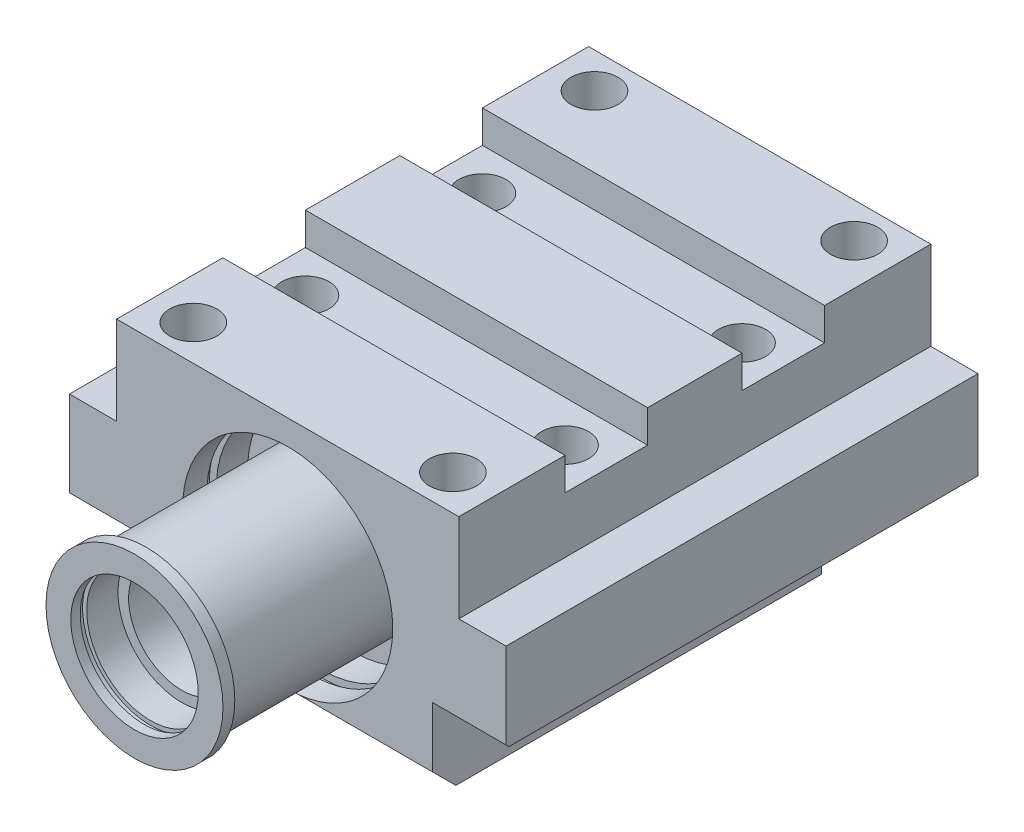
ISO-10303-21;
HEADER;
FILE_DESCRIPTION(('STEP AP214'),'2;1');
FILE_NAME('part.step','',(''),(''),'','','');
FILE_SCHEMA(('AUTOMOTIVE_DESIGN { 1 0 10303 214 1 1 1 1 }'));
ENDSEC;
DATA;
#1=APPLICATION_CONTEXT('core data for automotive mechanical design processes');
#2=APPLICATION_PROTOCOL_DEFINITION('international standard','automotive_design',2000,#1);
#3=PRODUCT_CONTEXT('',#1,'mechanical');
#4=PRODUCT('Part','Part','',(#3));
#5=PRODUCT_RELATED_PRODUCT_CATEGORY('part','',(#4));
#6=PRODUCT_DEFINITION_FORMATION('','',#4);
#7=PRODUCT_DEFINITION_CONTEXT('part definition',#1,'design');
#8=PRODUCT_DEFINITION('design','',#6,#7);
#9=PRODUCT_DEFINITION_SHAPE('','',#8);
#10=(LENGTH_UNIT() NAMED_UNIT(*) SI_UNIT(.MILLI.,.METRE.));
#11=(NAMED_UNIT(*) PLANE_ANGLE_UNIT() SI_UNIT($,.RADIAN.));
#12=(NAMED_UNIT(*) SI_UNIT($,.STERADIAN.) SOLID_ANGLE_UNIT());
#13=UNCERTAINTY_MEASURE_WITH_UNIT(LENGTH_MEASURE(1.E-05),#10,'distance_accuracy_value','');
#14=(GEOMETRIC_REPRESENTATION_CONTEXT(3) GLOBAL_UNCERTAINTY_ASSIGNED_CONTEXT((#13)) GLOBAL_UNIT_ASSIGNED_CONTEXT((#10,
#11,#12)) REPRESENTATION_CONTEXT('',''));
#15=CARTESIAN_POINT('',(0.,0.,0.));
#16=DIRECTION('',(0.,0.,1.));
#17=DIRECTION('',(1.,0.,0.));
#18=AXIS2_PLACEMENT_3D('',#15,#16,#17);
#19=CARTESIAN_POINT('',(0.,0.,0.));
#20=DIRECTION('',(0.,-1.,0.));
#21=DIRECTION('',(0.,0.,-1.));
#22=AXIS2_PLACEMENT_3D('',#19,#20,#21);
#23=PLANE('',#22);
#24=DIRECTION('',(0.,0.,-1.));
#25=VECTOR('',#24,1.);
#26=CARTESIAN_POINT('',(29.,0.,-40.));
#27=LINE('',#26,#25);
#28=CARTESIAN_POINT('',(29.,0.,7.99999999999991));
#29=VERTEX_POINT('',#28);
#30=CARTESIAN_POINT('',(29.,0.,-8.));
#31=VERTEX_POINT('',#30);
#32=EDGE_CURVE('E467',#29,#31,#27,.T.);
#33=ORIENTED_EDGE('',*,*,#32,.T.);
#34=DIRECTION('',(-1.,0.,0.));
#35=VECTOR('',#34,1.);
#36=CARTESIAN_POINT('',(0.,0.,-8.));
#37=LINE('',#36,#35);
#38=CARTESIAN_POINT('',(-29.,0.,-8.));
#39=VERTEX_POINT('',#38);
#40=EDGE_CURVE('E550',#31,#39,#37,.T.);
#41=ORIENTED_EDGE('',*,*,#40,.T.);
#42=DIRECTION('',(0.,0.,1.));
#43=VECTOR('',#42,1.);
#44=CARTESIAN_POINT('',(-29.,0.,7.9999999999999));
#45=LINE('',#44,#43);
#46=CARTESIAN_POINT('',(-29.,0.,7.9999999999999));
#47=VERTEX_POINT('',#46);
#48=EDGE_CURVE('E460',#39,#47,#45,.T.);
#49=ORIENTED_EDGE('',*,*,#48,.T.);
#50=DIRECTION('',(1.,0.,0.));
#51=VECTOR('',#50,1.);
#52=CARTESIAN_POINT('',(29.,0.,7.99999999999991));
#53=LINE('',#52,#51);
#54=EDGE_CURVE('E464',#47,#29,#53,.T.);
#55=ORIENTED_EDGE('',*,*,#54,.T.);
#56=EDGE_LOOP('',(#33,#41,#49,#55));
#57=FACE_BOUND('',#56,.T.);
#58=ADVANCED_FACE('F17',(#57),#23,.F.);
#59=CARTESIAN_POINT('',(22.0000000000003,-5.5,34.));
#60=DIRECTION('',(0.,1.,0.));
#61=DIRECTION('',(0.,0.,1.));
#62=AXIS2_PLACEMENT_3D('',#59,#60,#61);
#63=PLANE('',#62);
#64=CARTESIAN_POINT('',(-22.,-5.5,15.0000000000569));
#65=DIRECTION('',(0.,1.,0.));
#66=DIRECTION('',(0.,0.,1.));
#67=AXIS2_PLACEMENT_3D('',#64,#65,#66);
#68=CIRCLE('',#67,4.);
#69=CARTESIAN_POINT('',(-22.,-5.5,19.0000000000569));
#70=VERTEX_POINT('',#69);
#71=EDGE_CURVE('E750',#70,#70,#68,.T.);
#72=ORIENTED_EDGE('',*,*,#71,.F.);
#73=EDGE_LOOP('',(#72));
#74=FACE_BOUND('',#73,.T.);
#75=CARTESIAN_POINT('',(22.,-5.5,15.0000000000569));
#76=DIRECTION('',(0.,1.,0.));
#77=DIRECTION('',(0.,0.,1.));
#78=AXIS2_PLACEMENT_3D('',#75,#76,#77);
#79=CIRCLE('',#78,4.);
#80=CARTESIAN_POINT('',(22.,-5.5,19.0000000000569));
#81=VERTEX_POINT('',#80);
#82=EDGE_CURVE('E752',#81,#81,#79,.T.);
#83=ORIENTED_EDGE('',*,*,#82,.F.);
#84=EDGE_LOOP('',(#83));
#85=FACE_BOUND('',#84,.T.);
#86=DIRECTION('',(0.,0.,1.));
#87=VECTOR('',#86,1.);
#88=CARTESIAN_POINT('',(29.,-5.5,22.));
#89=LINE('',#88,#87);
#90=CARTESIAN_POINT('',(29.,-5.5,7.99999999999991));
#91=VERTEX_POINT('',#90);
#92=CARTESIAN_POINT('',(29.,-5.5,22.));
#93=VERTEX_POINT('',#92);
#94=EDGE_CURVE('E513',#91,#93,#89,.T.);
#95=ORIENTED_EDGE('',*,*,#94,.F.);
#96=DIRECTION('',(1.,0.,0.));
#97=VECTOR('',#96,1.);
#98=CARTESIAN_POINT('',(29.,-5.5,7.99999999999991));
#99=LINE('',#98,#97);
#100=CARTESIAN_POINT('',(-29.,-5.5,7.9999999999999));
#101=VERTEX_POINT('',#100);
#102=EDGE_CURVE('E452',#101,#91,#99,.T.);
#103=ORIENTED_EDGE('',*,*,#102,.F.);
#104=DIRECTION('',(0.,0.,-1.));
#105=VECTOR('',#104,1.);
#106=CARTESIAN_POINT('',(-29.,-5.5,11.0000000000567));
#107=LINE('',#106,#105);
#108=CARTESIAN_POINT('',(-29.,-5.5,22.));
#109=VERTEX_POINT('',#108);
#110=EDGE_CURVE('E532',#109,#101,#107,.T.);
#111=ORIENTED_EDGE('',*,*,#110,.F.);
#112=DIRECTION('',(-1.,0.,0.));
#113=VECTOR('',#112,1.);
#114=CARTESIAN_POINT('',(-26.,-5.5,22.));
#115=LINE('',#114,#113);
#116=EDGE_CURVE('E537',#93,#109,#115,.T.);
#117=ORIENTED_EDGE('',*,*,#116,.F.);
#118=EDGE_LOOP('',(#95,#103,#111,#117));
#119=FACE_BOUND('',#118,.T.);
#120=ADVANCED_FACE('F675',(#74,#85,#119),#63,.T.);
#121=CARTESIAN_POINT('',(29.,0.,-4.48388668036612E-13));
#122=DIRECTION('',(-1.,0.,0.));
#123=DIRECTION('',(0.,0.,1.));
#124=AXIS2_PLACEMENT_3D('',#121,#122,#123);
#125=PLANE('',#124);
#126=DIRECTION('',(0.,0.,1.));
#127=VECTOR('',#126,1.);
#128=CARTESIAN_POINT('',(29.,-5.5,-4.48388668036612E-13));
#129=LINE('',#128,#127);
#130=CARTESIAN_POINT('',(28.9999999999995,-5.5,-22.));
#131=VERTEX_POINT('',#130);
#132=CARTESIAN_POINT('',(28.9999999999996,-5.5,-8.));
#133=VERTEX_POINT('',#132);
#134=EDGE_CURVE('E410',#131,#133,#129,.T.);
#135=ORIENTED_EDGE('',*,*,#134,.T.);
#136=DIRECTION('',(0.,1.,0.));
#137=VECTOR('',#136,1.);
#138=CARTESIAN_POINT('',(29.,0.,-8.));
#139=LINE('',#138,#137);
#140=EDGE_CURVE('E407',#133,#31,#139,.T.);
#141=ORIENTED_EDGE('',*,*,#140,.T.);
#142=ORIENTED_EDGE('',*,*,#32,.F.);
#143=DIRECTION('',(0.,-1.,0.));
#144=VECTOR('',#143,1.);
#145=CARTESIAN_POINT('',(29.,0.,7.99999999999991));
#146=LINE('',#145,#144);
#147=EDGE_CURVE('E470',#29,#91,#146,.T.);
#148=ORIENTED_EDGE('',*,*,#147,.T.);
#149=ORIENTED_EDGE('',*,*,#94,.T.);
#150=DIRECTION('',(0.,1.,0.));
#151=VECTOR('',#150,1.);
#152=CARTESIAN_POINT('',(29.,0.,22.));
#153=LINE('',#152,#151);
#154=CARTESIAN_POINT('',(29.,0.,22.));
#155=VERTEX_POINT('',#154);
#156=EDGE_CURVE('E515',#93,#155,#153,.T.);
#157=ORIENTED_EDGE('',*,*,#156,.T.);
#158=DIRECTION('',(0.,0.,1.));
#159=VECTOR('',#158,1.);
#160=CARTESIAN_POINT('',(29.0000000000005,0.,40.));
#161=LINE('',#160,#159);
#162=CARTESIAN_POINT('',(29.0000000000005,0.,40.));
#163=VERTEX_POINT('',#162);
#164=EDGE_CURVE('E518',#155,#163,#161,.T.);
#165=ORIENTED_EDGE('',*,*,#164,.T.);
#166=DIRECTION('',(0.,-1.,0.));
#167=VECTOR('',#166,1.);
#168=CARTESIAN_POINT('',(29.0000000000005,-43.7,40.));
#169=LINE('',#168,#167);
#170=CARTESIAN_POINT('',(29.0000000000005,-15.,40.));
#171=VERTEX_POINT('',#170);
#172=EDGE_CURVE('E521',#163,#171,#169,.T.);
#173=ORIENTED_EDGE('',*,*,#172,.T.);
#174=DIRECTION('',(0.,0.,1.));
#175=VECTOR('',#174,1.);
#176=CARTESIAN_POINT('',(29.0000000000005,-15.,40.));
#177=LINE('',#176,#175);
#178=CARTESIAN_POINT('',(29.,-15.,-40.));
#179=VERTEX_POINT('',#178);
#180=EDGE_CURVE('E476',#179,#171,#177,.T.);
#181=ORIENTED_EDGE('',*,*,#180,.F.);
#182=DIRECTION('',(0.,-1.,0.));
#183=VECTOR('',#182,1.);
#184=CARTESIAN_POINT('',(29.,-43.7,-40.));
#185=LINE('',#184,#183);
#186=CARTESIAN_POINT('',(29.,0.,-40.));
#187=VERTEX_POINT('',#186);
#188=EDGE_CURVE('E510',#187,#179,#185,.T.);
#189=ORIENTED_EDGE('',*,*,#188,.F.);
#190=CARTESIAN_POINT('',(29.,0.,-22.));
#191=VERTEX_POINT('',#190);
#192=EDGE_CURVE('E466',#191,#187,#27,.T.);
#193=ORIENTED_EDGE('',*,*,#192,.F.);
#194=DIRECTION('',(0.,-1.,0.));
#195=VECTOR('',#194,1.);
#196=CARTESIAN_POINT('',(28.9999999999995,1.11022302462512E-13,-22.));
#197=LINE('',#196,#195);
#198=EDGE_CURVE('E403',#191,#131,#197,.T.);
#199=ORIENTED_EDGE('',*,*,#198,.T.);
#200=EDGE_LOOP('',(#135,#141,#142,#148,#149,#157,#165,#173,#181,#189,#193,#199));
#201=FACE_BOUND('',#200,.T.);
#202=ADVANCED_FACE('F635',(#201),#125,.F.);
#203=CARTESIAN_POINT('',(-29.,0.,0.));
#204=DIRECTION('',(1.,0.,0.));
#205=DIRECTION('',(0.,0.,-1.));
#206=AXIS2_PLACEMENT_3D('',#203,#204,#205);
#207=PLANE('',#206);
#208=ORIENTED_EDGE('',*,*,#48,.F.);
#209=DIRECTION('',(0.,1.,0.));
#210=VECTOR('',#209,1.);
#211=CARTESIAN_POINT('',(-29.,-5.5,-8.));
#212=LINE('',#211,#210);
#213=CARTESIAN_POINT('',(-29.,-5.5,-8.));
#214=VERTEX_POINT('',#213);
#215=EDGE_CURVE('E392',#214,#39,#212,.T.);
#216=ORIENTED_EDGE('',*,*,#215,.F.);
#217=DIRECTION('',(0.,0.,1.));
#218=VECTOR('',#217,1.);
#219=CARTESIAN_POINT('',(-29.,-5.5,-22.));
#220=LINE('',#219,#218);
#221=CARTESIAN_POINT('',(-29.,-5.5,-22.));
#222=VERTEX_POINT('',#221);
#223=EDGE_CURVE('E397',#222,#214,#220,.T.);
#224=ORIENTED_EDGE('',*,*,#223,.F.);
#225=DIRECTION('',(0.,-1.,0.));
#226=VECTOR('',#225,1.);
#227=CARTESIAN_POINT('',(-29.,0.,-22.));
#228=LINE('',#227,#226);
#229=CARTESIAN_POINT('',(-29.,0.,-22.));
#230=VERTEX_POINT('',#229);
#231=EDGE_CURVE('E394',#230,#222,#228,.T.);
#232=ORIENTED_EDGE('',*,*,#231,.F.);
#233=CARTESIAN_POINT('',(-29.,0.,-40.));
#234=VERTEX_POINT('',#233);
#235=EDGE_CURVE('E461',#234,#230,#45,.T.);
#236=ORIENTED_EDGE('',*,*,#235,.F.);
#237=DIRECTION('',(0.,1.,0.));
#238=VECTOR('',#237,1.);
#239=CARTESIAN_POINT('',(-29.,-5.5,-40.));
#240=LINE('',#239,#238);
#241=CARTESIAN_POINT('',(-29.,-15.,-40.));
#242=VERTEX_POINT('',#241);
#243=EDGE_CURVE('E508',#242,#234,#240,.T.);
#244=ORIENTED_EDGE('',*,*,#243,.F.);
#245=DIRECTION('',(0.,0.,-1.));
#246=VECTOR('',#245,1.);
#247=CARTESIAN_POINT('',(-29.,-15.,-40.));
#248=LINE('',#247,#246);
#249=CARTESIAN_POINT('',(-29.,-15.,40.));
#250=VERTEX_POINT('',#249);
#251=EDGE_CURVE('E492',#250,#242,#248,.T.);
#252=ORIENTED_EDGE('',*,*,#251,.F.);
#253=DIRECTION('',(0.,1.,0.));
#254=VECTOR('',#253,1.);
#255=CARTESIAN_POINT('',(-29.,0.,40.));
#256=LINE('',#255,#254);
#257=CARTESIAN_POINT('',(-29.,0.,40.));
#258=VERTEX_POINT('',#257);
#259=EDGE_CURVE('E523',#250,#258,#256,.T.);
#260=ORIENTED_EDGE('',*,*,#259,.T.);
#261=DIRECTION('',(0.,0.,-1.));
#262=VECTOR('',#261,1.);
#263=CARTESIAN_POINT('',(-29.,0.,22.));
#264=LINE('',#263,#262);
#265=CARTESIAN_POINT('',(-29.,0.,22.));
#266=VERTEX_POINT('',#265);
#267=EDGE_CURVE('E526',#258,#266,#264,.T.);
#268=ORIENTED_EDGE('',*,*,#267,.T.);
#269=DIRECTION('',(0.,-1.,0.));
#270=VECTOR('',#269,1.);
#271=CARTESIAN_POINT('',(-29.,-5.5,22.));
#272=LINE('',#271,#270);
#273=EDGE_CURVE('E529',#266,#109,#272,.T.);
#274=ORIENTED_EDGE('',*,*,#273,.T.);
#275=ORIENTED_EDGE('',*,*,#110,.T.);
#276=DIRECTION('',(0.,-1.,0.));
#277=VECTOR('',#276,1.);
#278=CARTESIAN_POINT('',(-29.,0.,7.9999999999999));
#279=LINE('',#278,#277);
#280=EDGE_CURVE('E474',#47,#101,#279,.T.);
#281=ORIENTED_EDGE('',*,*,#280,.F.);
#282=EDGE_LOOP('',(#208,#216,#224,#232,#236,#244,#252,#260,#268,#274,#275,#281));
#283=FACE_BOUND('',#282,.T.);
#284=ADVANCED_FACE('F628',(#283),#207,.F.);
#285=CARTESIAN_POINT('',(-22.,0.,33.9999999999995));
#286=DIRECTION('',(0.,-1.,0.));
#287=DIRECTION('',(0.,0.,-1.));
#288=AXIS2_PLACEMENT_3D('',#285,#286,#287);
#289=PLANE('',#288);
#290=CARTESIAN_POINT('',(-22.,0.,34.));
#291=DIRECTION('',(0.,1.,0.));
#292=DIRECTION('',(0.,0.,1.));
#293=AXIS2_PLACEMENT_3D('',#290,#291,#292);
#294=CIRCLE('',#293,4.);
#295=CARTESIAN_POINT('',(-22.,0.,38.));
#296=VERTEX_POINT('',#295);
#297=EDGE_CURVE('E757',#296,#296,#294,.T.);
#298=ORIENTED_EDGE('',*,*,#297,.F.);
#299=EDGE_LOOP('',(#298));
#300=FACE_BOUND('',#299,.T.);
#301=CARTESIAN_POINT('',(22.,0.,34.));
#302=DIRECTION('',(0.,1.,0.));
#303=DIRECTION('',(0.,0.,1.));
#304=AXIS2_PLACEMENT_3D('',#301,#302,#303);
#305=CIRCLE('',#304,4.00000000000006);
#306=CARTESIAN_POINT('',(22.,0.,38.0000000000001));
#307=VERTEX_POINT('',#306);
#308=EDGE_CURVE('E760',#307,#307,#305,.T.);
#309=ORIENTED_EDGE('',*,*,#308,.F.);
#310=EDGE_LOOP('',(#309));
#311=FACE_BOUND('',#310,.T.);
#312=ORIENTED_EDGE('',*,*,#267,.F.);
#313=DIRECTION('',(-1.,0.,0.));
#314=VECTOR('',#313,1.);
#315=CARTESIAN_POINT('',(-26.,0.,40.));
#316=LINE('',#315,#314);
#317=EDGE_CURVE('E535',#163,#258,#316,.T.);
#318=ORIENTED_EDGE('',*,*,#317,.F.);
#319=ORIENTED_EDGE('',*,*,#164,.F.);
#320=DIRECTION('',(-1.,0.,0.));
#321=VECTOR('',#320,1.);
#322=CARTESIAN_POINT('',(-26.,0.,22.));
#323=LINE('',#322,#321);
#324=EDGE_CURVE('E538',#155,#266,#323,.T.);
#325=ORIENTED_EDGE('',*,*,#324,.T.);
#326=EDGE_LOOP('',(#312,#318,#319,#325));
#327=FACE_BOUND('',#326,.T.);
#328=ADVANCED_FACE('F1491',(#300,#311,#327),#289,.F.);
#329=CARTESIAN_POINT('',(22.0000000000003,-43.7,34.));
#330=DIRECTION('',(0.,1.,0.));
#331=DIRECTION('',(0.,0.,1.));
#332=AXIS2_PLACEMENT_3D('',#329,#330,#331);
#333=PLANE('',#332);
#334=DIRECTION('',(0.,0.,1.));
#335=VECTOR('',#334,1.);
#336=CARTESIAN_POINT('',(24.5,-43.7,-40.));
#337=LINE('',#336,#335);
#338=CARTESIAN_POINT('',(24.5,-43.7,-26.));
#339=VERTEX_POINT('',#338);
#340=CARTESIAN_POINT('',(24.5,-43.7,36.));
#341=VERTEX_POINT('',#340);
#342=EDGE_CURVE('E453',#339,#341,#337,.T.);
#343=ORIENTED_EDGE('',*,*,#342,.T.);
#344=DIRECTION('',(-1.,0.,0.));
#345=VECTOR('',#344,1.);
#346=CARTESIAN_POINT('',(22.0000000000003,-43.7,36.));
#347=LINE('',#346,#345);
#348=CARTESIAN_POINT('',(-24.5,-43.7,36.));
#349=VERTEX_POINT('',#348);
#350=EDGE_CURVE('E27',#341,#349,#347,.T.);
#351=ORIENTED_EDGE('',*,*,#350,.T.);
#352=DIRECTION('',(0.,0.,1.));
#353=VECTOR('',#352,1.);
#354=CARTESIAN_POINT('',(-24.5,-43.7,-40.));
#355=LINE('',#354,#353);
#356=CARTESIAN_POINT('',(-24.5,-43.7,-26.));
#357=VERTEX_POINT('',#356);
#358=EDGE_CURVE('E433',#357,#349,#355,.T.);
#359=ORIENTED_EDGE('',*,*,#358,.F.);
#360=DIRECTION('',(1.,0.,0.));
#361=VECTOR('',#360,1.);
#362=CARTESIAN_POINT('',(-37.,-43.7,-26.));
#363=LINE('',#362,#361);
#364=EDGE_CURVE('E422',#357,#339,#363,.T.);
#365=ORIENTED_EDGE('',*,*,#364,.T.);
#366=EDGE_LOOP('',(#343,#351,#359,#365));
#367=FACE_BOUND('',#366,.T.);
#368=ADVANCED_FACE('F658',(#367),#333,.F.);
#369=CARTESIAN_POINT('',(-26.,0.,22.));
#370=DIRECTION('',(0.,0.,1.));
#371=DIRECTION('',(1.,0.,0.));
#372=AXIS2_PLACEMENT_3D('',#369,#370,#371);
#373=PLANE('',#372);
#374=ORIENTED_EDGE('',*,*,#116,.T.);
#375=ORIENTED_EDGE('',*,*,#273,.F.);
#376=ORIENTED_EDGE('',*,*,#324,.F.);
#377=ORIENTED_EDGE('',*,*,#156,.F.);
#378=EDGE_LOOP('',(#374,#375,#376,#377));
#379=FACE_BOUND('',#378,.T.);
#380=ADVANCED_FACE('F1473',(#379),#373,.F.);
#381=CARTESIAN_POINT('',(0.,0.,40.));
#382=DIRECTION('',(0.,0.,-1.));
#383=DIRECTION('',(-1.,0.,0.));
#384=AXIS2_PLACEMENT_3D('',#381,#382,#383);
#385=PLANE('',#384);
#386=DIRECTION('',(0.,1.,0.));
#387=VECTOR('',#386,1.);
#388=CARTESIAN_POINT('',(-24.5,-43.7,40.));
#389=LINE('',#388,#387);
#390=CARTESIAN_POINT('',(-24.5,-39.7,40.));
#391=VERTEX_POINT('',#390);
#392=CARTESIAN_POINT('',(-24.5,-29.5,40.));
#393=VERTEX_POINT('',#392);
#394=EDGE_CURVE('E421',#391,#393,#389,.T.);
#395=ORIENTED_EDGE('',*,*,#394,.F.);
#396=DIRECTION('',(1.,0.,0.));
#397=VECTOR('',#396,1.);
#398=CARTESIAN_POINT('',(0.,-39.7,40.));
#399=LINE('',#398,#397);
#400=CARTESIAN_POINT('',(-1.88414436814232,-39.7,40.));
#401=VERTEX_POINT('',#400);
#402=EDGE_CURVE('E583',#391,#401,#399,.T.);
#403=ORIENTED_EDGE('',*,*,#402,.T.);
#404=CARTESIAN_POINT('',(0.,-22.,40.));
#405=DIRECTION('',(0.,0.,1.));
#406=DIRECTION('',(1.,0.,0.));
#407=AXIS2_PLACEMENT_3D('',#404,#405,#406);
#408=CIRCLE('',#407,17.8);
#409=CARTESIAN_POINT('',(1.88414436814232,-39.7,40.));
#410=VERTEX_POINT('',#409);
#411=EDGE_CURVE('E380',#410,#401,#408,.T.);
#412=ORIENTED_EDGE('',*,*,#411,.F.);
#413=DIRECTION('',(1.,0.,0.));
#414=VECTOR('',#413,1.);
#415=CARTESIAN_POINT('',(0.,-39.7,40.));
#416=LINE('',#415,#414);
#417=CARTESIAN_POINT('',(24.5,-39.7,40.));
#418=VERTEX_POINT('',#417);
#419=EDGE_CURVE('E581',#410,#418,#416,.T.);
#420=ORIENTED_EDGE('',*,*,#419,.T.);
#421=DIRECTION('',(0.,-1.,0.));
#422=VECTOR('',#421,1.);
#423=CARTESIAN_POINT('',(24.5,-30.,40.));
#424=LINE('',#423,#422);
#425=CARTESIAN_POINT('',(24.5,-29.5,40.));
#426=VERTEX_POINT('',#425);
#427=EDGE_CURVE('E435',#426,#418,#424,.T.);
#428=ORIENTED_EDGE('',*,*,#427,.F.);
#429=DIRECTION('',(1.,0.,0.));
#430=VECTOR('',#429,1.);
#431=CARTESIAN_POINT('',(0.,-29.5,40.));
#432=LINE('',#431,#430);
#433=CARTESIAN_POINT('',(37.0000000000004,-29.5,40.));
#434=VERTEX_POINT('',#433);
#435=EDGE_CURVE('E567',#426,#434,#432,.T.);
#436=ORIENTED_EDGE('',*,*,#435,.T.);
#437=DIRECTION('',(0.,-1.,0.));
#438=VECTOR('',#437,1.);
#439=CARTESIAN_POINT('',(37.0000000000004,-43.7,40.));
#440=LINE('',#439,#438);
#441=CARTESIAN_POINT('',(37.0000000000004,-15.,40.));
#442=VERTEX_POINT('',#441);
#443=EDGE_CURVE('E477',#442,#434,#440,.T.);
#444=ORIENTED_EDGE('',*,*,#443,.F.);
#445=DIRECTION('',(-1.,0.,0.));
#446=VECTOR('',#445,1.);
#447=CARTESIAN_POINT('',(37.0000000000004,-15.,40.));
#448=LINE('',#447,#446);
#449=EDGE_CURVE('E484',#442,#171,#448,.T.);
#450=ORIENTED_EDGE('',*,*,#449,.T.);
#451=ORIENTED_EDGE('',*,*,#172,.F.);
#452=ORIENTED_EDGE('',*,*,#317,.T.);
#453=ORIENTED_EDGE('',*,*,#259,.F.);
#454=DIRECTION('',(1.,0.,0.));
#455=VECTOR('',#454,1.);
#456=CARTESIAN_POINT('',(-37.,-15.,40.));
#457=LINE('',#456,#455);
#458=CARTESIAN_POINT('',(-37.,-15.,40.));
#459=VERTEX_POINT('',#458);
#460=EDGE_CURVE('E505',#459,#250,#457,.T.);
#461=ORIENTED_EDGE('',*,*,#460,.F.);
#462=DIRECTION('',(0.,1.,0.));
#463=VECTOR('',#462,1.);
#464=CARTESIAN_POINT('',(-37.,-15.,40.));
#465=LINE('',#464,#463);
#466=CARTESIAN_POINT('',(-37.,-29.5,40.));
#467=VERTEX_POINT('',#466);
#468=EDGE_CURVE('E496',#467,#459,#465,.T.);
#469=ORIENTED_EDGE('',*,*,#468,.F.);
#470=DIRECTION('',(1.,0.,0.));
#471=VECTOR('',#470,1.);
#472=CARTESIAN_POINT('',(0.,-29.5,40.));
#473=LINE('',#472,#471);
#474=EDGE_CURVE('E564',#467,#393,#473,.T.);
#475=ORIENTED_EDGE('',*,*,#474,.T.);
#476=EDGE_LOOP('',(#395,#403,#412,#420,#428,#436,#444,#450,#451,#452,#453,#461,#469,#475));
#477=FACE_BOUND('',#476,.T.);
#478=ADVANCED_FACE('F597',(#477),#385,.F.);
#479=CARTESIAN_POINT('',(0.,0.,-40.));
#480=DIRECTION('',(0.,0.,1.));
#481=DIRECTION('',(1.,0.,0.));
#482=AXIS2_PLACEMENT_3D('',#479,#480,#481);
#483=PLANE('',#482);
#484=CARTESIAN_POINT('',(-27.9999999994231,-22.5,-40.));
#485=DIRECTION('',(0.,0.,-1.));
#486=DIRECTION('',(0.,1.,0.));
#487=AXIS2_PLACEMENT_3D('',#484,#485,#486);
#488=CIRCLE('',#487,5.);
#489=CARTESIAN_POINT('',(-27.9999999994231,-17.5,-40.));
#490=VERTEX_POINT('',#489);
#491=EDGE_CURVE('E724',#490,#490,#488,.T.);
#492=ORIENTED_EDGE('',*,*,#491,.F.);
#493=EDGE_LOOP('',(#492));
#494=FACE_BOUND('',#493,.T.);
#495=CARTESIAN_POINT('',(28.0000000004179,-22.5,-40.));
#496=DIRECTION('',(0.,0.,-1.));
#497=DIRECTION('',(0.,1.,0.));
#498=AXIS2_PLACEMENT_3D('',#495,#496,#497);
#499=CIRCLE('',#498,5.);
#500=CARTESIAN_POINT('',(28.0000000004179,-17.5,-40.));
#501=VERTEX_POINT('',#500);
#502=EDGE_CURVE('E730',#501,#501,#499,.T.);
#503=ORIENTED_EDGE('',*,*,#502,.F.);
#504=EDGE_LOOP('',(#503));
#505=FACE_BOUND('',#504,.T.);
#506=CARTESIAN_POINT('',(0.,-22.,-40.));
#507=DIRECTION('',(0.,0.,1.));
#508=DIRECTION('',(1.,0.,0.));
#509=AXIS2_PLACEMENT_3D('',#506,#507,#508);
#510=CIRCLE('',#509,17.8);
#511=CARTESIAN_POINT('',(17.8,-22.,-40.));
#512=VERTEX_POINT('',#511);
#513=EDGE_CURVE('E297',#512,#512,#510,.T.);
#514=ORIENTED_EDGE('',*,*,#513,.T.);
#515=EDGE_LOOP('',(#514));
#516=FACE_BOUND('',#515,.T.);
#517=DIRECTION('',(0.,-1.,0.));
#518=VECTOR('',#517,1.);
#519=CARTESIAN_POINT('',(24.5,-30.,-40.));
#520=LINE('',#519,#518);
#521=CARTESIAN_POINT('',(24.5,-30.,-40.));
#522=VERTEX_POINT('',#521);
#523=CARTESIAN_POINT('',(24.5,-42.,-40.));
#524=VERTEX_POINT('',#523);
#525=EDGE_CURVE('E444',#522,#524,#520,.T.);
#526=ORIENTED_EDGE('',*,*,#525,.T.);
#527=DIRECTION('',(1.,0.,0.));
#528=VECTOR('',#527,1.);
#529=CARTESIAN_POINT('',(-37.,-42.,-40.));
#530=LINE('',#529,#528);
#531=CARTESIAN_POINT('',(-24.5,-42.,-40.));
#532=VERTEX_POINT('',#531);
#533=EDGE_CURVE('E419',#532,#524,#530,.T.);
#534=ORIENTED_EDGE('',*,*,#533,.F.);
#535=DIRECTION('',(0.,1.,0.));
#536=VECTOR('',#535,1.);
#537=CARTESIAN_POINT('',(-24.5,-43.7,-40.));
#538=LINE('',#537,#536);
#539=CARTESIAN_POINT('',(-24.5,-30.,-40.));
#540=VERTEX_POINT('',#539);
#541=EDGE_CURVE('E426',#532,#540,#538,.T.);
#542=ORIENTED_EDGE('',*,*,#541,.T.);
#543=DIRECTION('',(-1.,0.,0.));
#544=VECTOR('',#543,1.);
#545=CARTESIAN_POINT('',(-24.5,-30.,-40.));
#546=LINE('',#545,#544);
#547=CARTESIAN_POINT('',(-37.,-30.,-40.));
#548=VERTEX_POINT('',#547);
#549=EDGE_CURVE('E428',#540,#548,#546,.T.);
#550=ORIENTED_EDGE('',*,*,#549,.T.);
#551=DIRECTION('',(0.,-1.,0.));
#552=VECTOR('',#551,1.);
#553=CARTESIAN_POINT('',(-37.,-43.7,-40.));
#554=LINE('',#553,#552);
#555=CARTESIAN_POINT('',(-37.,-15.,-40.));
#556=VERTEX_POINT('',#555);
#557=EDGE_CURVE('E493',#556,#548,#554,.T.);
#558=ORIENTED_EDGE('',*,*,#557,.F.);
#559=DIRECTION('',(1.,0.,0.));
#560=VECTOR('',#559,1.);
#561=CARTESIAN_POINT('',(-37.,-15.,-40.));
#562=LINE('',#561,#560);
#563=EDGE_CURVE('E500',#556,#242,#562,.T.);
#564=ORIENTED_EDGE('',*,*,#563,.T.);
#565=ORIENTED_EDGE('',*,*,#243,.T.);
#566=DIRECTION('',(-1.,0.,0.));
#567=VECTOR('',#566,1.);
#568=CARTESIAN_POINT('',(-29.,0.,-40.));
#569=LINE('',#568,#567);
#570=EDGE_CURVE('E457',#187,#234,#569,.T.);
#571=ORIENTED_EDGE('',*,*,#570,.F.);
#572=ORIENTED_EDGE('',*,*,#188,.T.);
#573=DIRECTION('',(-1.,0.,0.));
#574=VECTOR('',#573,1.);
#575=CARTESIAN_POINT('',(36.9999999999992,-15.,-40.));
#576=LINE('',#575,#574);
#577=CARTESIAN_POINT('',(36.9999999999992,-15.,-40.));
#578=VERTEX_POINT('',#577);
#579=EDGE_CURVE('E489',#578,#179,#576,.T.);
#580=ORIENTED_EDGE('',*,*,#579,.F.);
#581=DIRECTION('',(0.,1.,0.));
#582=VECTOR('',#581,1.);
#583=CARTESIAN_POINT('',(36.9999999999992,-15.,-40.));
#584=LINE('',#583,#582);
#585=CARTESIAN_POINT('',(36.9999999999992,-30.,-40.));
#586=VERTEX_POINT('',#585);
#587=EDGE_CURVE('E480',#586,#578,#584,.T.);
#588=ORIENTED_EDGE('',*,*,#587,.F.);
#589=DIRECTION('',(-1.,0.,0.));
#590=VECTOR('',#589,1.);
#591=CARTESIAN_POINT('',(37.,-30.,-40.));
#592=LINE('',#591,#590);
#593=EDGE_CURVE('E441',#586,#522,#592,.T.);
#594=ORIENTED_EDGE('',*,*,#593,.T.);
#595=EDGE_LOOP('',(#526,#534,#542,#550,#558,#564,#565,#571,#572,#580,#588,#594));
#596=FACE_BOUND('',#595,.T.);
#597=ADVANCED_FACE('F615',(#494,#505,#516,#596),#483,.F.);
#598=CARTESIAN_POINT('',(-37.,-15.,-40.));
#599=DIRECTION('',(0.,-1.,0.));
#600=DIRECTION('',(0.,0.,-1.));
#601=AXIS2_PLACEMENT_3D('',#598,#599,#600);
#602=PLANE('',#601);
#603=ORIENTED_EDGE('',*,*,#251,.T.);
#604=ORIENTED_EDGE('',*,*,#563,.F.);
#605=DIRECTION('',(0.,0.,-1.));
#606=VECTOR('',#605,1.);
#607=CARTESIAN_POINT('',(-37.,-15.,-40.));
#608=LINE('',#607,#606);
#609=EDGE_CURVE('E498',#459,#556,#608,.T.);
#610=ORIENTED_EDGE('',*,*,#609,.F.);
#611=ORIENTED_EDGE('',*,*,#460,.T.);
#612=EDGE_LOOP('',(#603,#604,#610,#611));
#613=FACE_BOUND('',#612,.T.);
#614=ADVANCED_FACE('F622',(#613),#602,.F.);
#615=CARTESIAN_POINT('',(-37.,0.,0.));
#616=DIRECTION('',(1.,0.,0.));
#617=DIRECTION('',(0.,0.,-1.));
#618=AXIS2_PLACEMENT_3D('',#615,#616,#617);
#619=PLANE('',#618);
#620=DIRECTION('',(0.,0.,1.));
#621=VECTOR('',#620,1.);
#622=CARTESIAN_POINT('',(-37.,-30.,-40.));
#623=LINE('',#622,#621);
#624=CARTESIAN_POINT('',(-37.,-30.,39.5));
#625=VERTEX_POINT('',#624);
#626=EDGE_CURVE('E436',#548,#625,#623,.T.);
#627=ORIENTED_EDGE('',*,*,#626,.T.);
#628=DIRECTION('',(0.,-0.707106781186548,-0.707106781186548));
#629=VECTOR('',#628,1.);
#630=CARTESIAN_POINT('',(-37.,-30.,39.5));
#631=LINE('',#630,#629);
#632=EDGE_CURVE('E574',#625,#467,#631,.F.);
#633=ORIENTED_EDGE('',*,*,#632,.T.);
#634=ORIENTED_EDGE('',*,*,#468,.T.);
#635=ORIENTED_EDGE('',*,*,#609,.T.);
#636=ORIENTED_EDGE('',*,*,#557,.T.);
#637=EDGE_LOOP('',(#627,#633,#634,#635,#636));
#638=FACE_BOUND('',#637,.T.);
#639=ADVANCED_FACE('F618',(#638),#619,.F.);
#640=CARTESIAN_POINT('',(37.0000000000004,-15.,40.));
#641=DIRECTION('',(0.,-1.,0.));
#642=DIRECTION('',(0.,0.,-1.));
#643=AXIS2_PLACEMENT_3D('',#640,#641,#642);
#644=PLANE('',#643);
#645=ORIENTED_EDGE('',*,*,#180,.T.);
#646=ORIENTED_EDGE('',*,*,#449,.F.);
#647=DIRECTION('',(0.,0.,1.));
#648=VECTOR('',#647,1.);
#649=CARTESIAN_POINT('',(37.0000000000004,-15.,40.));
#650=LINE('',#649,#648);
#651=EDGE_CURVE('E482',#578,#442,#650,.T.);
#652=ORIENTED_EDGE('',*,*,#651,.F.);
#653=ORIENTED_EDGE('',*,*,#579,.T.);
#654=EDGE_LOOP('',(#645,#646,#652,#653));
#655=FACE_BOUND('',#654,.T.);
#656=ADVANCED_FACE('F640',(#655),#644,.F.);
#657=CARTESIAN_POINT('',(37.,0.,-5.7137060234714E-13));
#658=DIRECTION('',(-1.,0.,0.));
#659=DIRECTION('',(0.,0.,1.));
#660=AXIS2_PLACEMENT_3D('',#657,#658,#659);
#661=PLANE('',#660);
#662=ORIENTED_EDGE('',*,*,#443,.T.);
#663=DIRECTION('',(0.,0.707106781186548,0.707106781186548));
#664=VECTOR('',#663,1.);
#665=CARTESIAN_POINT('',(37.,-30.,39.5));
#666=LINE('',#665,#664);
#667=CARTESIAN_POINT('',(37.,-30.,39.5));
#668=VERTEX_POINT('',#667);
#669=EDGE_CURVE('E569',#434,#668,#666,.F.);
#670=ORIENTED_EDGE('',*,*,#669,.T.);
#671=DIRECTION('',(0.,0.,1.));
#672=VECTOR('',#671,1.);
#673=CARTESIAN_POINT('',(37.,-30.,-40.));
#674=LINE('',#673,#672);
#675=EDGE_CURVE('E449',#586,#668,#674,.T.);
#676=ORIENTED_EDGE('',*,*,#675,.F.);
#677=ORIENTED_EDGE('',*,*,#587,.T.);
#678=ORIENTED_EDGE('',*,*,#651,.T.);
#679=EDGE_LOOP('',(#662,#670,#676,#677,#678));
#680=FACE_BOUND('',#679,.T.);
#681=ADVANCED_FACE('F644',(#680),#661,.F.);
#682=CARTESIAN_POINT('',(29.,0.,7.99999999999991));
#683=DIRECTION('',(0.,0.,-1.));
#684=DIRECTION('',(-1.,0.,0.));
#685=AXIS2_PLACEMENT_3D('',#682,#683,#684);
#686=PLANE('',#685);
#687=ORIENTED_EDGE('',*,*,#102,.T.);
#688=ORIENTED_EDGE('',*,*,#147,.F.);
#689=ORIENTED_EDGE('',*,*,#54,.F.);
#690=ORIENTED_EDGE('',*,*,#280,.T.);
#691=EDGE_LOOP('',(#687,#688,#689,#690));
#692=FACE_BOUND('',#691,.T.);
#693=ADVANCED_FACE('F687',(#692),#686,.F.);
#694=CARTESIAN_POINT('',(-22.,0.,-34.));
#695=DIRECTION('',(0.,1.,0.));
#696=DIRECTION('',(0.,0.,1.));
#697=AXIS2_PLACEMENT_3D('',#694,#695,#696);
#698=CIRCLE('',#697,4.);
#699=CARTESIAN_POINT('',(-22.,0.,-30.));
#700=VERTEX_POINT('',#699);
#701=EDGE_CURVE('E698',#700,#700,#698,.T.);
#702=ORIENTED_EDGE('',*,*,#701,.F.);
#703=EDGE_LOOP('',(#702));
#704=FACE_BOUND('',#703,.T.);
#705=CARTESIAN_POINT('',(22.,0.,-34.));
#706=DIRECTION('',(0.,1.,0.));
#707=DIRECTION('',(0.,0.,1.));
#708=AXIS2_PLACEMENT_3D('',#705,#706,#707);
#709=CIRCLE('',#708,4.);
#710=CARTESIAN_POINT('',(22.,0.,-30.));
#711=VERTEX_POINT('',#710);
#712=EDGE_CURVE('E701',#711,#711,#709,.T.);
#713=ORIENTED_EDGE('',*,*,#712,.F.);
#714=EDGE_LOOP('',(#713));
#715=FACE_BOUND('',#714,.T.);
#716=ORIENTED_EDGE('',*,*,#235,.T.);
#717=DIRECTION('',(1.,0.,0.));
#718=VECTOR('',#717,1.);
#719=CARTESIAN_POINT('',(0.,0.,-22.));
#720=LINE('',#719,#718);
#721=EDGE_CURVE('E547',#230,#191,#720,.T.);
#722=ORIENTED_EDGE('',*,*,#721,.T.);
#723=ORIENTED_EDGE('',*,*,#192,.T.);
#724=ORIENTED_EDGE('',*,*,#570,.T.);
#725=EDGE_LOOP('',(#716,#722,#723,#724));
#726=FACE_BOUND('',#725,.T.);
#727=ADVANCED_FACE('F631',(#704,#715,#726),#23,.F.);
#728=CARTESIAN_POINT('',(37.,-30.,-40.));
#729=DIRECTION('',(0.,1.,0.));
#730=DIRECTION('',(-1.,0.,0.));
#731=AXIS2_PLACEMENT_3D('',#728,#729,#730);
#732=PLANE('',#731);
#733=ORIENTED_EDGE('',*,*,#675,.T.);
#734=DIRECTION('',(-1.,0.,0.));
#735=VECTOR('',#734,1.);
#736=CARTESIAN_POINT('',(37.,-30.,39.5));
#737=LINE('',#736,#735);
#738=CARTESIAN_POINT('',(24.5,-30.,39.5));
#739=VERTEX_POINT('',#738);
#740=EDGE_CURVE('E561',#668,#739,#737,.T.);
#741=ORIENTED_EDGE('',*,*,#740,.T.);
#742=DIRECTION('',(0.,0.,1.));
#743=VECTOR('',#742,1.);
#744=CARTESIAN_POINT('',(24.5,-30.,-40.));
#745=LINE('',#744,#743);
#746=EDGE_CURVE('E447',#522,#739,#745,.T.);
#747=ORIENTED_EDGE('',*,*,#746,.F.);
#748=ORIENTED_EDGE('',*,*,#593,.F.);
#749=EDGE_LOOP('',(#733,#741,#747,#748));
#750=FACE_BOUND('',#749,.T.);
#751=ADVANCED_FACE('F649',(#750),#732,.F.);
#752=CARTESIAN_POINT('',(24.5,-30.,-40.));
#753=DIRECTION('',(-1.,0.,0.));
#754=DIRECTION('',(0.,0.,1.));
#755=AXIS2_PLACEMENT_3D('',#752,#753,#754);
#756=PLANE('',#755);
#757=ORIENTED_EDGE('',*,*,#427,.T.);
#758=DIRECTION('',(0.,0.707106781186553,0.707106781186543));
#759=VECTOR('',#758,1.);
#760=CARTESIAN_POINT('',(24.5,-39.7,40.));
#761=LINE('',#760,#759);
#762=EDGE_CURVE('E41',#418,#341,#761,.F.);
#763=ORIENTED_EDGE('',*,*,#762,.T.);
#764=ORIENTED_EDGE('',*,*,#342,.F.);
#765=DIRECTION('',(0.,-1.,0.));
#766=VECTOR('',#765,1.);
#767=CARTESIAN_POINT('',(24.5,-42.,-26.));
#768=LINE('',#767,#766);
#769=CARTESIAN_POINT('',(24.5,-42.,-26.));
#770=VERTEX_POINT('',#769);
#771=EDGE_CURVE('E416',#770,#339,#768,.T.);
#772=ORIENTED_EDGE('',*,*,#771,.F.);
#773=DIRECTION('',(0.,0.,1.));
#774=VECTOR('',#773,1.);
#775=CARTESIAN_POINT('',(24.5,-42.,-40.));
#776=LINE('',#775,#774);
#777=EDGE_CURVE('E413',#524,#770,#776,.T.);
#778=ORIENTED_EDGE('',*,*,#777,.F.);
#779=ORIENTED_EDGE('',*,*,#525,.F.);
#780=ORIENTED_EDGE('',*,*,#746,.T.);
#781=DIRECTION('',(0.,-0.707106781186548,-0.707106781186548));
#782=VECTOR('',#781,1.);
#783=CARTESIAN_POINT('',(24.5,-69.75,-0.250000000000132));
#784=LINE('',#783,#782);
#785=EDGE_CURVE('E576',#739,#426,#784,.F.);
#786=ORIENTED_EDGE('',*,*,#785,.T.);
#787=EDGE_LOOP('',(#757,#763,#764,#772,#778,#779,#780,#786));
#788=FACE_BOUND('',#787,.T.);
#789=ADVANCED_FACE('F652',(#788),#756,.F.);
#790=CARTESIAN_POINT('',(-24.5,-43.7,-40.));
#791=DIRECTION('',(1.,0.,0.));
#792=DIRECTION('',(0.,0.,-1.));
#793=AXIS2_PLACEMENT_3D('',#790,#791,#792);
#794=PLANE('',#793);
#795=ORIENTED_EDGE('',*,*,#358,.T.);
#796=DIRECTION('',(0.,-0.707106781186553,-0.707106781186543));
#797=VECTOR('',#796,1.);
#798=CARTESIAN_POINT('',(-24.5,-39.7,40.));
#799=LINE('',#798,#797);
#800=EDGE_CURVE('E11',#349,#391,#799,.F.);
#801=ORIENTED_EDGE('',*,*,#800,.T.);
#802=ORIENTED_EDGE('',*,*,#394,.T.);
#803=DIRECTION('',(0.,0.707106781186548,0.707106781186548));
#804=VECTOR('',#803,1.);
#805=CARTESIAN_POINT('',(-24.5,-76.6,-7.10000000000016));
#806=LINE('',#805,#804);
#807=CARTESIAN_POINT('',(-24.5,-30.,39.5));
#808=VERTEX_POINT('',#807);
#809=EDGE_CURVE('E579',#393,#808,#806,.F.);
#810=ORIENTED_EDGE('',*,*,#809,.T.);
#811=DIRECTION('',(0.,0.,1.));
#812=VECTOR('',#811,1.);
#813=CARTESIAN_POINT('',(-24.5,-30.,-40.));
#814=LINE('',#813,#812);
#815=EDGE_CURVE('E431',#540,#808,#814,.T.);
#816=ORIENTED_EDGE('',*,*,#815,.F.);
#817=ORIENTED_EDGE('',*,*,#541,.F.);
#818=DIRECTION('',(0.,0.,1.));
#819=VECTOR('',#818,1.);
#820=CARTESIAN_POINT('',(-24.5,-42.,-40.));
#821=LINE('',#820,#819);
#822=CARTESIAN_POINT('',(-24.5,-42.,-26.));
#823=VERTEX_POINT('',#822);
#824=EDGE_CURVE('E544',#532,#823,#821,.T.);
#825=ORIENTED_EDGE('',*,*,#824,.T.);
#826=DIRECTION('',(0.,-1.,0.));
#827=VECTOR('',#826,1.);
#828=CARTESIAN_POINT('',(-24.5,-43.7,-26.));
#829=LINE('',#828,#827);
#830=EDGE_CURVE('E540',#823,#357,#829,.T.);
#831=ORIENTED_EDGE('',*,*,#830,.T.);
#832=EDGE_LOOP('',(#795,#801,#802,#810,#816,#817,#825,#831));
#833=FACE_BOUND('',#832,.T.);
#834=ADVANCED_FACE('F600',(#833),#794,.F.);
#835=CARTESIAN_POINT('',(-24.5,-30.,-40.));
#836=DIRECTION('',(0.,1.,0.));
#837=DIRECTION('',(-1.,0.,0.));
#838=AXIS2_PLACEMENT_3D('',#835,#836,#837);
#839=PLANE('',#838);
#840=ORIENTED_EDGE('',*,*,#815,.T.);
#841=DIRECTION('',(-1.,0.,0.));
#842=VECTOR('',#841,1.);
#843=CARTESIAN_POINT('',(-24.5,-30.,39.5));
#844=LINE('',#843,#842);
#845=EDGE_CURVE('E571',#808,#625,#844,.T.);
#846=ORIENTED_EDGE('',*,*,#845,.T.);
#847=ORIENTED_EDGE('',*,*,#626,.F.);
#848=ORIENTED_EDGE('',*,*,#549,.F.);
#849=EDGE_LOOP('',(#840,#846,#847,#848));
#850=FACE_BOUND('',#849,.T.);
#851=ADVANCED_FACE('F612',(#850),#839,.F.);
#852=CARTESIAN_POINT('',(-37.,-42.,-40.));
#853=DIRECTION('',(0.,1.,0.));
#854=DIRECTION('',(0.,0.,1.));
#855=AXIS2_PLACEMENT_3D('',#852,#853,#854);
#856=PLANE('',#855);
#857=ORIENTED_EDGE('',*,*,#533,.T.);
#858=ORIENTED_EDGE('',*,*,#777,.T.);
#859=DIRECTION('',(1.,0.,0.));
#860=VECTOR('',#859,1.);
#861=CARTESIAN_POINT('',(-37.,-42.,-26.));
#862=LINE('',#861,#860);
#863=EDGE_CURVE('E418',#823,#770,#862,.T.);
#864=ORIENTED_EDGE('',*,*,#863,.F.);
#865=ORIENTED_EDGE('',*,*,#824,.F.);
#866=EDGE_LOOP('',(#857,#858,#864,#865));
#867=FACE_BOUND('',#866,.T.);
#868=ADVANCED_FACE('F656',(#867),#856,.F.);
#869=CARTESIAN_POINT('',(-37.,-42.,-26.));
#870=DIRECTION('',(0.,0.,1.));
#871=DIRECTION('',(0.,-1.,0.));
#872=AXIS2_PLACEMENT_3D('',#869,#870,#871);
#873=PLANE('',#872);
#874=ORIENTED_EDGE('',*,*,#863,.T.);
#875=ORIENTED_EDGE('',*,*,#771,.T.);
#876=ORIENTED_EDGE('',*,*,#364,.F.);
#877=ORIENTED_EDGE('',*,*,#830,.F.);
#878=EDGE_LOOP('',(#874,#875,#876,#877));
#879=FACE_BOUND('',#878,.T.);
#880=ADVANCED_FACE('F659',(#879),#873,.F.);
#881=CARTESIAN_POINT('',(37.0000000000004,-5.5,-22.));
#882=DIRECTION('',(0.,-1.,0.));
#883=DIRECTION('',(0.,0.,-1.));
#884=AXIS2_PLACEMENT_3D('',#881,#882,#883);
#885=PLANE('',#884);
#886=CARTESIAN_POINT('',(-22.,-5.5,-15.));
#887=DIRECTION('',(0.,1.,0.));
#888=DIRECTION('',(0.,0.,1.));
#889=AXIS2_PLACEMENT_3D('',#886,#887,#888);
#890=CIRCLE('',#889,4.);
#891=CARTESIAN_POINT('',(-22.,-5.5,-11.));
#892=VERTEX_POINT('',#891);
#893=EDGE_CURVE('E707',#892,#892,#890,.T.);
#894=ORIENTED_EDGE('',*,*,#893,.F.);
#895=EDGE_LOOP('',(#894));
#896=FACE_BOUND('',#895,.T.);
#897=CARTESIAN_POINT('',(22.,-5.5,-15.));
#898=DIRECTION('',(0.,1.,0.));
#899=DIRECTION('',(0.,0.,1.));
#900=AXIS2_PLACEMENT_3D('',#897,#898,#899);
#901=CIRCLE('',#900,4.);
#902=CARTESIAN_POINT('',(22.,-5.5,-11.));
#903=VERTEX_POINT('',#902);
#904=EDGE_CURVE('E718',#903,#903,#901,.T.);
#905=ORIENTED_EDGE('',*,*,#904,.F.);
#906=EDGE_LOOP('',(#905));
#907=FACE_BOUND('',#906,.T.);
#908=DIRECTION('',(-1.,0.,0.));
#909=VECTOR('',#908,1.);
#910=CARTESIAN_POINT('',(37.0000000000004,-5.5,-22.));
#911=LINE('',#910,#909);
#912=EDGE_CURVE('E400',#131,#222,#911,.T.);
#913=ORIENTED_EDGE('',*,*,#912,.T.);
#914=ORIENTED_EDGE('',*,*,#223,.T.);
#915=DIRECTION('',(-1.,0.,0.));
#916=VECTOR('',#915,1.);
#917=CARTESIAN_POINT('',(37.0000000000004,-5.5,-8.));
#918=LINE('',#917,#916);
#919=EDGE_CURVE('E401',#133,#214,#918,.T.);
#920=ORIENTED_EDGE('',*,*,#919,.F.);
#921=ORIENTED_EDGE('',*,*,#134,.F.);
#922=EDGE_LOOP('',(#913,#914,#920,#921));
#923=FACE_BOUND('',#922,.T.);
#924=ADVANCED_FACE('F661',(#896,#907,#923),#885,.F.);
#925=CARTESIAN_POINT('',(37.0000000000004,-5.5,-8.));
#926=DIRECTION('',(0.,0.,1.));
#927=DIRECTION('',(0.,-1.,0.));
#928=AXIS2_PLACEMENT_3D('',#925,#926,#927);
#929=PLANE('',#928);
#930=ORIENTED_EDGE('',*,*,#919,.T.);
#931=ORIENTED_EDGE('',*,*,#215,.T.);
#932=ORIENTED_EDGE('',*,*,#40,.F.);
#933=ORIENTED_EDGE('',*,*,#140,.F.);
#934=EDGE_LOOP('',(#930,#931,#932,#933));
#935=FACE_BOUND('',#934,.T.);
#936=ADVANCED_FACE('F669',(#935),#929,.F.);
#937=CARTESIAN_POINT('',(37.0000000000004,0.,-22.));
#938=DIRECTION('',(0.,0.,-1.));
#939=DIRECTION('',(0.,1.,0.));
#940=AXIS2_PLACEMENT_3D('',#937,#938,#939);
#941=PLANE('',#940);
#942=ORIENTED_EDGE('',*,*,#721,.F.);
#943=ORIENTED_EDGE('',*,*,#231,.T.);
#944=ORIENTED_EDGE('',*,*,#912,.F.);
#945=ORIENTED_EDGE('',*,*,#198,.F.);
#946=EDGE_LOOP('',(#942,#943,#944,#945));
#947=FACE_BOUND('',#946,.T.);
#948=ADVANCED_FACE('F1350',(#947),#941,.F.);
#949=CARTESIAN_POINT('',(0.,-22.,-2.03039600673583));
#950=DIRECTION('',(0.,0.,1.));
#951=DIRECTION('',(0.,-1.,0.));
#952=AXIS2_PLACEMENT_3D('',#949,#950,#951);
#953=PLANE('',#952);
#954=CARTESIAN_POINT('',(0.,-22.0000000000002,-2.03039600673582));
#955=DIRECTION('',(0.,0.,-1.));
#956=DIRECTION('',(0.,1.,0.));
#957=AXIS2_PLACEMENT_3D('',#954,#955,#956);
#958=CIRCLE('',#957,13.5);
#959=CARTESIAN_POINT('',(0.,-8.50000000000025,-2.03039600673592));
#960=VERTEX_POINT('',#959);
#961=EDGE_CURVE('E363',#960,#960,#958,.T.);
#962=ORIENTED_EDGE('',*,*,#961,.F.);
#963=EDGE_LOOP('',(#962));
#964=FACE_BOUND('',#963,.T.);
#965=CARTESIAN_POINT('',(0.,-22.,-2.03039600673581));
#966=DIRECTION('',(0.,0.,-1.));
#967=DIRECTION('',(0.,1.,0.));
#968=AXIS2_PLACEMENT_3D('',#965,#966,#967);
#969=CIRCLE('',#968,14.);
#970=CARTESIAN_POINT('',(0.,-8.,-2.03039600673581));
#971=VERTEX_POINT('',#970);
#972=EDGE_CURVE('E389',#971,#971,#969,.T.);
#973=ORIENTED_EDGE('',*,*,#972,.T.);
#974=EDGE_LOOP('',(#973));
#975=FACE_BOUND('',#974,.T.);
#976=ADVANCED_FACE('F1340',(#964,#975),#953,.F.);
#977=CARTESIAN_POINT('',(0.,-22.,-40.));
#978=DIRECTION('',(0.,0.,-1.));
#979=DIRECTION('',(0.,1.,0.));
#980=AXIS2_PLACEMENT_3D('',#977,#978,#979);
#981=CYLINDRICAL_SURFACE('',#980,14.);
#982=CARTESIAN_POINT('',(0.,-22.,-32.));
#983=DIRECTION('',(0.,0.,1.));
#984=DIRECTION('',(1.,0.,0.));
#985=AXIS2_PLACEMENT_3D('',#982,#983,#984);
#986=CIRCLE('',#985,14.);
#987=CARTESIAN_POINT('',(14.,-22.,-32.));
#988=VERTEX_POINT('',#987);
#989=EDGE_CURVE('E294',#988,#988,#986,.T.);
#990=ORIENTED_EDGE('',*,*,#989,.F.);
#991=EDGE_LOOP('',(#990));
#992=FACE_BOUND('',#991,.T.);
#993=ORIENTED_EDGE('',*,*,#972,.F.);
#994=EDGE_LOOP('',(#993));
#995=FACE_BOUND('',#994,.T.);
#996=ADVANCED_FACE('F1330',(#992,#995),#981,.F.);
#997=CARTESIAN_POINT('',(17.8,-22.,29.));
#998=DIRECTION('',(0.,0.,-1.));
#999=DIRECTION('',(-1.,0.,0.));
#1000=AXIS2_PLACEMENT_3D('',#997,#998,#999);
#1001=PLANE('',#1000);
#1002=CARTESIAN_POINT('',(0.,-22.,29.));
#1003=DIRECTION('',(0.,0.,1.));
#1004=DIRECTION('',(1.,0.,0.));
#1005=AXIS2_PLACEMENT_3D('',#1002,#1003,#1004);
#1006=CIRCLE('',#1005,14.);
#1007=CARTESIAN_POINT('',(14.,-22.,29.));
#1008=VERTEX_POINT('',#1007);
#1009=EDGE_CURVE('E383',#1008,#1008,#1006,.T.);
#1010=ORIENTED_EDGE('',*,*,#1009,.F.);
#1011=EDGE_LOOP('',(#1010));
#1012=FACE_BOUND('',#1011,.T.);
#1013=CARTESIAN_POINT('',(0.,-22.,29.));
#1014=DIRECTION('',(0.,0.,1.));
#1015=DIRECTION('',(1.,0.,0.));
#1016=AXIS2_PLACEMENT_3D('',#1013,#1014,#1015);
#1017=CIRCLE('',#1016,17.8);
#1018=CARTESIAN_POINT('',(17.8,-22.,29.));
#1019=VERTEX_POINT('',#1018);
#1020=EDGE_CURVE('E366',#1019,#1019,#1017,.T.);
#1021=ORIENTED_EDGE('',*,*,#1020,.T.);
#1022=EDGE_LOOP('',(#1021));
#1023=FACE_BOUND('',#1022,.T.);
#1024=ADVANCED_FACE('F1320',(#1012,#1023),#1001,.F.);
#1025=CARTESIAN_POINT('',(0.,-22.,29.));
#1026=DIRECTION('',(0.,0.,1.));
#1027=DIRECTION('',(1.,0.,0.));
#1028=AXIS2_PLACEMENT_3D('',#1025,#1026,#1027);
#1029=CYLINDRICAL_SURFACE('',#1028,17.8);
#1030=CARTESIAN_POINT('',(0.,-22.,35.9));
#1031=DIRECTION('',(0.,0.,1.));
#1032=DIRECTION('',(1.,0.,0.));
#1033=AXIS2_PLACEMENT_3D('',#1030,#1031,#1032);
#1034=CIRCLE('',#1033,17.8);
#1035=CARTESIAN_POINT('',(17.8,-22.,35.9));
#1036=VERTEX_POINT('',#1035);
#1037=EDGE_CURVE('E377',#1036,#1036,#1034,.T.);
#1038=ORIENTED_EDGE('',*,*,#1037,.F.);
#1039=EDGE_LOOP('',(#1038));
#1040=FACE_BOUND('',#1039,.T.);
#1041=ORIENTED_EDGE('',*,*,#411,.T.);
#1042=CARTESIAN_POINT('',(0.,-22.,57.7));
#1043=DIRECTION('',(0.,0.707106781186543,-0.707106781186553));
#1044=DIRECTION('',(0.,0.707106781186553,0.707106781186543));
#1045=AXIS2_PLACEMENT_3D('',#1042,#1043,#1044);
#1046=ELLIPSE('',#1045,25.1730014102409,17.8);
#1047=EDGE_CURVE('E586',#401,#410,#1046,.F.);
#1048=ORIENTED_EDGE('',*,*,#1047,.T.);
#1049=EDGE_LOOP('',(#1041,#1048));
#1050=FACE_BOUND('',#1049,.T.);
#1051=ADVANCED_FACE('F591',(#1040,#1050),#1029,.F.);
#1052=CARTESIAN_POINT('',(17.8,-22.,35.9));
#1053=DIRECTION('',(0.,0.,1.));
#1054=DIRECTION('',(1.,0.,0.));
#1055=AXIS2_PLACEMENT_3D('',#1052,#1053,#1054);
#1056=PLANE('',#1055);
#1057=CARTESIAN_POINT('',(0.,-22.,35.9));
#1058=DIRECTION('',(0.,0.,1.));
#1059=DIRECTION('',(1.,0.,0.));
#1060=AXIS2_PLACEMENT_3D('',#1057,#1058,#1059);
#1061=CIRCLE('',#1060,19.);
#1062=CARTESIAN_POINT('',(19.,-22.,35.9));
#1063=VERTEX_POINT('',#1062);
#1064=EDGE_CURVE('E374',#1063,#1063,#1061,.T.);
#1065=ORIENTED_EDGE('',*,*,#1064,.F.);
#1066=EDGE_LOOP('',(#1065));
#1067=FACE_BOUND('',#1066,.T.);
#1068=ORIENTED_EDGE('',*,*,#1037,.T.);
#1069=EDGE_LOOP('',(#1068));
#1070=FACE_BOUND('',#1069,.T.);
#1071=ADVANCED_FACE('F1305',(#1067,#1070),#1056,.F.);
#1072=CARTESIAN_POINT('',(0.,-22.,29.));
#1073=DIRECTION('',(0.,0.,1.));
#1074=DIRECTION('',(1.,0.,0.));
#1075=AXIS2_PLACEMENT_3D('',#1072,#1073,#1074);
#1076=CYLINDRICAL_SURFACE('',#1075,19.);
#1077=CARTESIAN_POINT('',(0.,-22.,34.2999));
#1078=DIRECTION('',(0.,0.,1.));
#1079=DIRECTION('',(1.,0.,0.));
#1080=AXIS2_PLACEMENT_3D('',#1077,#1078,#1079);
#1081=CIRCLE('',#1080,19.);
#1082=CARTESIAN_POINT('',(18.0112583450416,-15.9506551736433,34.2999));
#1083=VERTEX_POINT('',#1082);
#1084=CARTESIAN_POINT('',(-18.0112583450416,-15.9506551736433,34.2999));
#1085=VERTEX_POINT('',#1084);
#1086=EDGE_CURVE('E240',#1083,#1085,#1081,.T.);
#1087=ORIENTED_EDGE('',*,*,#1086,.F.);
#1088=CARTESIAN_POINT('',(18.0112583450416,-15.9506551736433,34.2999));
#1089=CARTESIAN_POINT('',(18.0134470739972,-15.95716451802,34.3288679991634));
#1090=CARTESIAN_POINT('',(18.0159162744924,-15.9645312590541,34.3575607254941));
#1091=CARTESIAN_POINT('',(18.0214156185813,-15.9809795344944,34.4143956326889));
#1092=CARTESIAN_POINT('',(18.0244457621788,-15.9900610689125,34.4425378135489));
#1093=CARTESIAN_POINT('',(18.0277563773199,-16.,34.4704047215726));
#1094=B_SPLINE_CURVE_WITH_KNOTS('',3,(#1088,#1089,#1090,#1091,#1092,#1093),.UNSPECIFIED.,.F.,
.F.,(4,2,4),(0.,0.0891781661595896,0.178356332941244),.UNSPECIFIED.);
#1095=CARTESIAN_POINT('',(18.0277563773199,-16.,34.4704047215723));
#1096=VERTEX_POINT('',#1095);
#1097=EDGE_CURVE('E227',#1083,#1096,#1094,.T.);
#1098=ORIENTED_EDGE('',*,*,#1097,.T.);
#1099=DIRECTION('',(0.,0.,1.));
#1100=VECTOR('',#1099,1.);
#1101=CARTESIAN_POINT('',(18.0277563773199,-16.,29.));
#1102=LINE('',#1101,#1100);
#1103=CARTESIAN_POINT('',(18.0277563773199,-16.,34.2999));
#1104=VERTEX_POINT('',#1103);
#1105=EDGE_CURVE('E216',#1096,#1104,#1102,.F.);
#1106=ORIENTED_EDGE('',*,*,#1105,.T.);
#1107=CARTESIAN_POINT('',(-18.0277563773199,-16.,34.2999));
#1108=VERTEX_POINT('',#1107);
#1109=EDGE_CURVE('E372',#1108,#1104,#1081,.T.);
#1110=ORIENTED_EDGE('',*,*,#1109,.F.);
#1111=DIRECTION('',(0.,0.,1.));
#1112=VECTOR('',#1111,1.);
#1113=CARTESIAN_POINT('',(-18.0277563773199,-16.,29.));
#1114=LINE('',#1113,#1112);
#1115=CARTESIAN_POINT('',(-18.0277563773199,-16.,34.4704047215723));
#1116=VERTEX_POINT('',#1115);
#1117=EDGE_CURVE('E244',#1108,#1116,#1114,.T.);
#1118=ORIENTED_EDGE('',*,*,#1117,.T.);
#1119=CARTESIAN_POINT('',(-18.0277563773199,-16.,34.4704047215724));
#1120=CARTESIAN_POINT('',(-18.0244457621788,-15.9900610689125,34.4425378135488));
#1121=CARTESIAN_POINT('',(-18.0214156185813,-15.9809795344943,34.4143956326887));
#1122=CARTESIAN_POINT('',(-18.0159162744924,-15.9645312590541,34.3575607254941));
#1123=CARTESIAN_POINT('',(-18.0134470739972,-15.95716451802,34.3288679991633));
#1124=CARTESIAN_POINT('',(-18.0112583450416,-15.9506551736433,34.2999));
#1125=B_SPLINE_CURVE_WITH_KNOTS('',3,(#1119,#1120,#1121,#1122,#1123,#1124),.UNSPECIFIED.,.F.,
.F.,(4,2,4),(0.,0.0891781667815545,0.178356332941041),.UNSPECIFIED.);
#1126=EDGE_CURVE('E273',#1116,#1085,#1125,.T.);
#1127=ORIENTED_EDGE('',*,*,#1126,.T.);
#1128=EDGE_LOOP('',(#1087,#1098,#1106,#1110,#1118,#1127));
#1129=FACE_BOUND('',#1128,.T.);
#1130=ORIENTED_EDGE('',*,*,#1064,.T.);
#1131=EDGE_LOOP('',(#1130));
#1132=FACE_BOUND('',#1131,.T.);
#1133=ADVANCED_FACE('F237',(#1129,#1132),#1076,.F.);
#1134=CARTESIAN_POINT('',(19.,-22.,34.2999));
#1135=DIRECTION('',(0.,0.,-1.));
#1136=DIRECTION('',(-1.,0.,0.));
#1137=AXIS2_PLACEMENT_3D('',#1134,#1135,#1136);
#1138=PLANE('',#1137);
#1139=CARTESIAN_POINT('',(0.,-22.,34.2999));
#1140=DIRECTION('',(0.,0.,1.));
#1141=DIRECTION('',(1.,0.,0.));
#1142=AXIS2_PLACEMENT_3D('',#1139,#1140,#1141);
#1143=CIRCLE('',#1142,17.8);
#1144=CARTESIAN_POINT('',(17.8,-22.,34.2999));
#1145=VERTEX_POINT('',#1144);
#1146=EDGE_CURVE('E369',#1145,#1145,#1143,.T.);
#1147=ORIENTED_EDGE('',*,*,#1146,.F.);
#1148=EDGE_LOOP('',(#1147));
#1149=FACE_BOUND('',#1148,.T.);
#1150=DIRECTION('',(-1.,0.,0.));
#1151=VECTOR('',#1150,1.);
#1152=CARTESIAN_POINT('',(19.,-16.,34.2999));
#1153=LINE('',#1152,#1151);
#1154=CARTESIAN_POINT('',(18.0112583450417,-16.,34.2999));
#1155=VERTEX_POINT('',#1154);
#1156=EDGE_CURVE('E222',#1104,#1155,#1153,.T.);
#1157=ORIENTED_EDGE('',*,*,#1156,.T.);
#1158=DIRECTION('',(0.,1.,0.));
#1159=VECTOR('',#1158,1.);
#1160=CARTESIAN_POINT('',(18.0112583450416,-16.,34.2999));
#1161=LINE('',#1160,#1159);
#1162=EDGE_CURVE('E233',#1155,#1083,#1161,.T.);
#1163=ORIENTED_EDGE('',*,*,#1162,.T.);
#1164=ORIENTED_EDGE('',*,*,#1086,.T.);
#1165=DIRECTION('',(0.,1.,0.));
#1166=VECTOR('',#1165,1.);
#1167=CARTESIAN_POINT('',(-18.0112583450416,-16.,34.2999));
#1168=LINE('',#1167,#1166);
#1169=CARTESIAN_POINT('',(-18.0112583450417,-16.,34.2999));
#1170=VERTEX_POINT('',#1169);
#1171=EDGE_CURVE('E556',#1085,#1170,#1168,.F.);
#1172=ORIENTED_EDGE('',*,*,#1171,.T.);
#1173=DIRECTION('',(-1.,0.,0.));
#1174=VECTOR('',#1173,1.);
#1175=CARTESIAN_POINT('',(19.,-16.,34.2999));
#1176=LINE('',#1175,#1174);
#1177=EDGE_CURVE('E553',#1170,#1108,#1176,.T.);
#1178=ORIENTED_EDGE('',*,*,#1177,.T.);
#1179=ORIENTED_EDGE('',*,*,#1109,.T.);
#1180=EDGE_LOOP('',(#1157,#1163,#1164,#1172,#1178,#1179));
#1181=FACE_BOUND('',#1180,.T.);
#1182=ADVANCED_FACE('F1288',(#1149,#1181),#1138,.F.);
#1183=CARTESIAN_POINT('',(0.,-22.,29.));
#1184=DIRECTION('',(0.,0.,1.));
#1185=DIRECTION('',(1.,0.,0.));
#1186=AXIS2_PLACEMENT_3D('',#1183,#1184,#1185);
#1187=CYLINDRICAL_SURFACE('',#1186,17.8);
#1188=ORIENTED_EDGE('',*,*,#1020,.F.);
#1189=EDGE_LOOP('',(#1188));
#1190=FACE_BOUND('',#1189,.T.);
#1191=ORIENTED_EDGE('',*,*,#1146,.T.);
#1192=EDGE_LOOP('',(#1191));
#1193=FACE_BOUND('',#1192,.T.);
#1194=ADVANCED_FACE('F1279',(#1190,#1193),#1187,.F.);
#1195=CARTESIAN_POINT('',(0.,-22.,27.9696039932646));
#1196=DIRECTION('',(0.,0.,-1.));
#1197=DIRECTION('',(-1.,0.,0.));
#1198=AXIS2_PLACEMENT_3D('',#1195,#1196,#1197);
#1199=PLANE('',#1198);
#1200=CARTESIAN_POINT('',(0.,-22.,27.9696039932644));
#1201=DIRECTION('',(0.,0.,1.));
#1202=DIRECTION('',(1.,0.,0.));
#1203=AXIS2_PLACEMENT_3D('',#1200,#1201,#1202);
#1204=CIRCLE('',#1203,13.5);
#1205=CARTESIAN_POINT('',(13.5,-22.,27.9696039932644));
#1206=VERTEX_POINT('',#1205);
#1207=EDGE_CURVE('E345',#1206,#1206,#1204,.T.);
#1208=ORIENTED_EDGE('',*,*,#1207,.F.);
#1209=EDGE_LOOP('',(#1208));
#1210=FACE_BOUND('',#1209,.T.);
#1211=CARTESIAN_POINT('',(0.,-22.,27.9696039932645));
#1212=DIRECTION('',(0.,0.,1.));
#1213=DIRECTION('',(1.,0.,0.));
#1214=AXIS2_PLACEMENT_3D('',#1211,#1212,#1213);
#1215=CIRCLE('',#1214,14.);
#1216=CARTESIAN_POINT('',(14.,-22.,27.9696039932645));
#1217=VERTEX_POINT('',#1216);
#1218=EDGE_CURVE('E386',#1217,#1217,#1215,.T.);
#1219=ORIENTED_EDGE('',*,*,#1218,.T.);
#1220=EDGE_LOOP('',(#1219));
#1221=FACE_BOUND('',#1220,.T.);
#1222=ADVANCED_FACE('F1269',(#1210,#1221),#1199,.F.);
#1223=CARTESIAN_POINT('',(0.,-22.,40.));
#1224=DIRECTION('',(0.,0.,1.));
#1225=DIRECTION('',(1.,0.,0.));
#1226=AXIS2_PLACEMENT_3D('',#1223,#1224,#1225);
#1227=CYLINDRICAL_SURFACE('',#1226,14.);
#1228=ORIENTED_EDGE('',*,*,#1009,.T.);
#1229=EDGE_LOOP('',(#1228));
#1230=FACE_BOUND('',#1229,.T.);
#1231=ORIENTED_EDGE('',*,*,#1218,.F.);
#1232=EDGE_LOOP('',(#1231));
#1233=FACE_BOUND('',#1232,.T.);
#1234=ADVANCED_FACE('F1259',(#1230,#1233),#1227,.F.);
#1235=CARTESIAN_POINT('',(0.,-22.0000000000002,-2.03039600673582));
#1236=DIRECTION('',(0.,0.,-1.));
#1237=DIRECTION('',(0.,1.,0.));
#1238=AXIS2_PLACEMENT_3D('',#1235,#1236,#1237);
#1239=CYLINDRICAL_SURFACE('',#1238,13.5);
#1240=ORIENTED_EDGE('',*,*,#961,.T.);
#1241=EDGE_LOOP('',(#1240));
#1242=FACE_BOUND('',#1241,.T.);
#1243=CARTESIAN_POINT('',(0.,-22.0000000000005,-39.8303960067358));
#1244=DIRECTION('',(0.,0.,-1.));
#1245=DIRECTION('',(0.,1.,0.));
#1246=AXIS2_PLACEMENT_3D('',#1243,#1244,#1245);
#1247=CIRCLE('',#1246,13.5);
#1248=CARTESIAN_POINT('',(0.,-8.5000000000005,-39.8303960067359));
#1249=VERTEX_POINT('',#1248);
#1250=EDGE_CURVE('E348',#1249,#1249,#1247,.T.);
#1251=ORIENTED_EDGE('',*,*,#1250,.F.);
#1252=EDGE_LOOP('',(#1251));
#1253=FACE_BOUND('',#1252,.T.);
#1254=ADVANCED_FACE('F1249',(#1242,#1253),#1239,.T.);
#1255=CARTESIAN_POINT('',(0.,-22.0000000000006,-42.0303960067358));
#1256=DIRECTION('',(0.,0.,-1.));
#1257=DIRECTION('',(0.,1.,0.));
#1258=AXIS2_PLACEMENT_3D('',#1255,#1256,#1257);
#1259=PLANE('',#1258);
#1260=CARTESIAN_POINT('',(0.,-22.,-42.0303960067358));
#1261=DIRECTION('',(0.,0.,1.));
#1262=DIRECTION('',(1.,0.,0.));
#1263=AXIS2_PLACEMENT_3D('',#1260,#1261,#1262);
#1264=CIRCLE('',#1263,10.8);
#1265=CARTESIAN_POINT('',(10.8,-22.,-42.0303960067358));
#1266=VERTEX_POINT('',#1265);
#1267=EDGE_CURVE('E333',#1266,#1266,#1264,.T.);
#1268=ORIENTED_EDGE('',*,*,#1267,.T.);
#1269=EDGE_LOOP('',(#1268));
#1270=FACE_BOUND('',#1269,.T.);
#1271=CARTESIAN_POINT('',(0.,-22.0000000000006,-42.0303960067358));
#1272=DIRECTION('',(0.,0.,-1.));
#1273=DIRECTION('',(0.,1.,0.));
#1274=AXIS2_PLACEMENT_3D('',#1271,#1272,#1273);
#1275=CIRCLE('',#1274,13.5);
#1276=CARTESIAN_POINT('',(0.,-8.50000000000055,-42.0303960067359));
#1277=VERTEX_POINT('',#1276);
#1278=EDGE_CURVE('E360',#1277,#1277,#1275,.T.);
#1279=ORIENTED_EDGE('',*,*,#1278,.T.);
#1280=EDGE_LOOP('',(#1279));
#1281=FACE_BOUND('',#1280,.T.);
#1282=ADVANCED_FACE('F1239',(#1270,#1281),#1259,.T.);
#1283=CARTESIAN_POINT('',(0.,-22.0000000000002,-2.03039600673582));
#1284=DIRECTION('',(0.,0.,-1.));
#1285=DIRECTION('',(0.,1.,0.));
#1286=AXIS2_PLACEMENT_3D('',#1283,#1284,#1285);
#1287=CYLINDRICAL_SURFACE('',#1286,13.5);
#1288=CARTESIAN_POINT('',(0.,-22.0000000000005,-41.1303960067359));
#1289=DIRECTION('',(0.,0.,-1.));
#1290=DIRECTION('',(0.,1.,0.));
#1291=AXIS2_PLACEMENT_3D('',#1288,#1289,#1290);
#1292=CIRCLE('',#1291,13.5);
#1293=CARTESIAN_POINT('',(0.,-8.5000000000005,-41.1303960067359));
#1294=VERTEX_POINT('',#1293);
#1295=EDGE_CURVE('E357',#1294,#1294,#1292,.T.);
#1296=ORIENTED_EDGE('',*,*,#1295,.T.);
#1297=EDGE_LOOP('',(#1296));
#1298=FACE_BOUND('',#1297,.T.);
#1299=ORIENTED_EDGE('',*,*,#1278,.F.);
#1300=EDGE_LOOP('',(#1299));
#1301=FACE_BOUND('',#1300,.T.);
#1302=ADVANCED_FACE('F1229',(#1298,#1301),#1287,.T.);
#1303=CARTESIAN_POINT('',(13.5,-22.0000000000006,-41.1303960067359));
#1304=DIRECTION('',(0.,0.,1.));
#1305=DIRECTION('',(0.,-1.,0.));
#1306=AXIS2_PLACEMENT_3D('',#1303,#1304,#1305);
#1307=PLANE('',#1306);
#1308=CARTESIAN_POINT('',(0.,-22.0000000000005,-41.1303960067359));
#1309=DIRECTION('',(0.,0.,-1.));
#1310=DIRECTION('',(0.,1.,0.));
#1311=AXIS2_PLACEMENT_3D('',#1308,#1309,#1310);
#1312=CIRCLE('',#1311,12.8);
#1313=CARTESIAN_POINT('',(0.,-9.2000000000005,-41.1303960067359));
#1314=VERTEX_POINT('',#1313);
#1315=EDGE_CURVE('E354',#1314,#1314,#1312,.T.);
#1316=ORIENTED_EDGE('',*,*,#1315,.T.);
#1317=EDGE_LOOP('',(#1316));
#1318=FACE_BOUND('',#1317,.T.);
#1319=ORIENTED_EDGE('',*,*,#1295,.F.);
#1320=EDGE_LOOP('',(#1319));
#1321=FACE_BOUND('',#1320,.T.);
#1322=ADVANCED_FACE('F1219',(#1318,#1321),#1307,.T.);
#1323=CARTESIAN_POINT('',(0.,-22.0000000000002,-2.03039600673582));
#1324=DIRECTION('',(0.,0.,-1.));
#1325=DIRECTION('',(0.,1.,0.));
#1326=AXIS2_PLACEMENT_3D('',#1323,#1324,#1325);
#1327=CYLINDRICAL_SURFACE('',#1326,12.8);
#1328=CARTESIAN_POINT('',(0.,-22.0000000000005,-39.8303960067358));
#1329=DIRECTION('',(0.,0.,-1.));
#1330=DIRECTION('',(0.,1.,0.));
#1331=AXIS2_PLACEMENT_3D('',#1328,#1329,#1330);
#1332=CIRCLE('',#1331,12.8);
#1333=CARTESIAN_POINT('',(0.,-9.2000000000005,-39.8303960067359));
#1334=VERTEX_POINT('',#1333);
#1335=EDGE_CURVE('E351',#1334,#1334,#1332,.T.);
#1336=ORIENTED_EDGE('',*,*,#1335,.T.);
#1337=EDGE_LOOP('',(#1336));
#1338=FACE_BOUND('',#1337,.T.);
#1339=ORIENTED_EDGE('',*,*,#1315,.F.);
#1340=EDGE_LOOP('',(#1339));
#1341=FACE_BOUND('',#1340,.T.);
#1342=ADVANCED_FACE('F1209',(#1338,#1341),#1327,.T.);
#1343=CARTESIAN_POINT('',(12.8,-22.0000000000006,-39.8303960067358));
#1344=DIRECTION('',(0.,0.,-1.));
#1345=DIRECTION('',(0.,1.,0.));
#1346=AXIS2_PLACEMENT_3D('',#1343,#1344,#1345);
#1347=PLANE('',#1346);
#1348=ORIENTED_EDGE('',*,*,#1250,.T.);
#1349=EDGE_LOOP('',(#1348));
#1350=FACE_BOUND('',#1349,.T.);
#1351=ORIENTED_EDGE('',*,*,#1335,.F.);
#1352=EDGE_LOOP('',(#1351));
#1353=FACE_BOUND('',#1352,.T.);
#1354=ADVANCED_FACE('F1199',(#1350,#1353),#1347,.T.);
#1355=CARTESIAN_POINT('',(0.,-22.,27.9696039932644));
#1356=DIRECTION('',(0.,0.,1.));
#1357=DIRECTION('',(1.,0.,0.));
#1358=AXIS2_PLACEMENT_3D('',#1355,#1356,#1357);
#1359=CYLINDRICAL_SURFACE('',#1358,13.5);
#1360=ORIENTED_EDGE('',*,*,#1207,.T.);
#1361=EDGE_LOOP('',(#1360));
#1362=FACE_BOUND('',#1361,.T.);
#1363=CARTESIAN_POINT('',(0.,-22.,63.9696039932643));
#1364=DIRECTION('',(0.,0.,1.));
#1365=DIRECTION('',(1.,0.,0.));
#1366=AXIS2_PLACEMENT_3D('',#1363,#1364,#1365);
#1367=CIRCLE('',#1366,13.5);
#1368=CARTESIAN_POINT('',(13.5,-22.,63.9696039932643));
#1369=VERTEX_POINT('',#1368);
#1370=EDGE_CURVE('E336',#1369,#1369,#1367,.T.);
#1371=ORIENTED_EDGE('',*,*,#1370,.F.);
#1372=EDGE_LOOP('',(#1371));
#1373=FACE_BOUND('',#1372,.T.);
#1374=ADVANCED_FACE('F1189',(#1362,#1373),#1359,.T.);
#1375=CARTESIAN_POINT('',(0.,-22.,65.9696039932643));
#1376=DIRECTION('',(0.,0.,1.));
#1377=DIRECTION('',(1.,0.,0.));
#1378=AXIS2_PLACEMENT_3D('',#1375,#1376,#1377);
#1379=PLANE('',#1378);
#1380=CARTESIAN_POINT('',(0.,-22.,65.9696039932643));
#1381=DIRECTION('',(0.,0.,1.));
#1382=DIRECTION('',(1.,0.,0.));
#1383=AXIS2_PLACEMENT_3D('',#1380,#1381,#1382);
#1384=CIRCLE('',#1383,10.8);
#1385=CARTESIAN_POINT('',(10.8,-22.,65.9696039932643));
#1386=VERTEX_POINT('',#1385);
#1387=EDGE_CURVE('E330',#1386,#1386,#1384,.T.);
#1388=ORIENTED_EDGE('',*,*,#1387,.F.);
#1389=EDGE_LOOP('',(#1388));
#1390=FACE_BOUND('',#1389,.T.);
#1391=CARTESIAN_POINT('',(0.,-22.,65.9696039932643));
#1392=DIRECTION('',(0.,0.,1.));
#1393=DIRECTION('',(1.,0.,0.));
#1394=AXIS2_PLACEMENT_3D('',#1391,#1392,#1393);
#1395=CIRCLE('',#1394,15.);
#1396=CARTESIAN_POINT('',(15.,-22.,65.9696039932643));
#1397=VERTEX_POINT('',#1396);
#1398=EDGE_CURVE('E342',#1397,#1397,#1395,.T.);
#1399=ORIENTED_EDGE('',*,*,#1398,.T.);
#1400=EDGE_LOOP('',(#1399));
#1401=FACE_BOUND('',#1400,.T.);
#1402=ADVANCED_FACE('F1179',(#1390,#1401),#1379,.T.);
#1403=CARTESIAN_POINT('',(0.,-22.,27.9696039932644));
#1404=DIRECTION('',(0.,0.,1.));
#1405=DIRECTION('',(1.,0.,0.));
#1406=AXIS2_PLACEMENT_3D('',#1403,#1404,#1405);
#1407=CYLINDRICAL_SURFACE('',#1406,15.);
#1408=CARTESIAN_POINT('',(0.,-22.,63.9696039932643));
#1409=DIRECTION('',(0.,0.,1.));
#1410=DIRECTION('',(1.,0.,0.));
#1411=AXIS2_PLACEMENT_3D('',#1408,#1409,#1410);
#1412=CIRCLE('',#1411,15.);
#1413=CARTESIAN_POINT('',(15.,-22.,63.9696039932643));
#1414=VERTEX_POINT('',#1413);
#1415=EDGE_CURVE('E339',#1414,#1414,#1412,.T.);
#1416=ORIENTED_EDGE('',*,*,#1415,.T.);
#1417=EDGE_LOOP('',(#1416));
#1418=FACE_BOUND('',#1417,.T.);
#1419=ORIENTED_EDGE('',*,*,#1398,.F.);
#1420=EDGE_LOOP('',(#1419));
#1421=FACE_BOUND('',#1420,.T.);
#1422=ADVANCED_FACE('F1169',(#1418,#1421),#1407,.T.);
#1423=CARTESIAN_POINT('',(15.,-22.,63.9696039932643));
#1424=DIRECTION('',(0.,0.,-1.));
#1425=DIRECTION('',(-1.,0.,0.));
#1426=AXIS2_PLACEMENT_3D('',#1423,#1424,#1425);
#1427=PLANE('',#1426);
#1428=ORIENTED_EDGE('',*,*,#1370,.T.);
#1429=EDGE_LOOP('',(#1428));
#1430=FACE_BOUND('',#1429,.T.);
#1431=ORIENTED_EDGE('',*,*,#1415,.F.);
#1432=EDGE_LOOP('',(#1431));
#1433=FACE_BOUND('',#1432,.T.);
#1434=ADVANCED_FACE('F1159',(#1430,#1433),#1427,.T.);
#1435=CARTESIAN_POINT('',(0.,-22.,-42.0303960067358));
#1436=DIRECTION('',(0.,0.,1.));
#1437=DIRECTION('',(1.,0.,0.));
#1438=AXIS2_PLACEMENT_3D('',#1435,#1436,#1437);
#1439=CYLINDRICAL_SURFACE('',#1438,10.8);
#1440=ORIENTED_EDGE('',*,*,#1267,.F.);
#1441=EDGE_LOOP('',(#1440));
#1442=FACE_BOUND('',#1441,.T.);
#1443=CARTESIAN_POINT('',(0.,-22.,-39.9303960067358));
#1444=DIRECTION('',(0.,0.,1.));
#1445=DIRECTION('',(1.,0.,0.));
#1446=AXIS2_PLACEMENT_3D('',#1443,#1444,#1445);
#1447=CIRCLE('',#1446,10.8);
#1448=CARTESIAN_POINT('',(10.8,-22.,-39.9303960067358));
#1449=VERTEX_POINT('',#1448);
#1450=EDGE_CURVE('E300',#1449,#1449,#1447,.T.);
#1451=ORIENTED_EDGE('',*,*,#1450,.T.);
#1452=EDGE_LOOP('',(#1451));
#1453=FACE_BOUND('',#1452,.T.);
#1454=ADVANCED_FACE('F1149',(#1442,#1453),#1439,.F.);
#1455=CARTESIAN_POINT('',(0.,-22.,-42.0303960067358));
#1456=DIRECTION('',(0.,0.,1.));
#1457=DIRECTION('',(1.,0.,0.));
#1458=AXIS2_PLACEMENT_3D('',#1455,#1456,#1457);
#1459=CYLINDRICAL_SURFACE('',#1458,10.8);
#1460=CARTESIAN_POINT('',(0.,-22.,64.3696039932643));
#1461=DIRECTION('',(0.,0.,1.));
#1462=DIRECTION('',(1.,0.,0.));
#1463=AXIS2_PLACEMENT_3D('',#1460,#1461,#1462);
#1464=CIRCLE('',#1463,10.8);
#1465=CARTESIAN_POINT('',(10.8,-22.,64.3696039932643));
#1466=VERTEX_POINT('',#1465);
#1467=EDGE_CURVE('E327',#1466,#1466,#1464,.T.);
#1468=ORIENTED_EDGE('',*,*,#1467,.F.);
#1469=EDGE_LOOP('',(#1468));
#1470=FACE_BOUND('',#1469,.T.);
#1471=ORIENTED_EDGE('',*,*,#1387,.T.);
#1472=EDGE_LOOP('',(#1471));
#1473=FACE_BOUND('',#1472,.T.);
#1474=ADVANCED_FACE('F1139',(#1470,#1473),#1459,.F.);
#1475=CARTESIAN_POINT('',(10.8,-22.,64.3696039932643));
#1476=DIRECTION('',(0.,0.,1.));
#1477=DIRECTION('',(1.,0.,0.));
#1478=AXIS2_PLACEMENT_3D('',#1475,#1476,#1477);
#1479=PLANE('',#1478);
#1480=CARTESIAN_POINT('',(0.,-22.,64.3696039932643));
#1481=DIRECTION('',(0.,0.,1.));
#1482=DIRECTION('',(1.,0.,0.));
#1483=AXIS2_PLACEMENT_3D('',#1480,#1481,#1482);
#1484=CIRCLE('',#1483,11.5);
#1485=CARTESIAN_POINT('',(11.5,-22.,64.3696039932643));
#1486=VERTEX_POINT('',#1485);
#1487=EDGE_CURVE('E324',#1486,#1486,#1484,.T.);
#1488=ORIENTED_EDGE('',*,*,#1487,.F.);
#1489=EDGE_LOOP('',(#1488));
#1490=FACE_BOUND('',#1489,.T.);
#1491=ORIENTED_EDGE('',*,*,#1467,.T.);
#1492=EDGE_LOOP('',(#1491));
#1493=FACE_BOUND('',#1492,.T.);
#1494=ADVANCED_FACE('F1129',(#1490,#1493),#1479,.F.);
#1495=CARTESIAN_POINT('',(0.,-22.,-42.0303960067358));
#1496=DIRECTION('',(0.,0.,1.));
#1497=DIRECTION('',(1.,0.,0.));
#1498=AXIS2_PLACEMENT_3D('',#1495,#1496,#1497);
#1499=CYLINDRICAL_SURFACE('',#1498,11.5);
#1500=CARTESIAN_POINT('',(0.,-22.,63.2696039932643));
#1501=DIRECTION('',(0.,0.,1.));
#1502=DIRECTION('',(1.,0.,0.));
#1503=AXIS2_PLACEMENT_3D('',#1500,#1501,#1502);
#1504=CIRCLE('',#1503,11.5);
#1505=CARTESIAN_POINT('',(11.5,-22.,63.2696039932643));
#1506=VERTEX_POINT('',#1505);
#1507=EDGE_CURVE('E321',#1506,#1506,#1504,.T.);
#1508=ORIENTED_EDGE('',*,*,#1507,.F.);
#1509=EDGE_LOOP('',(#1508));
#1510=FACE_BOUND('',#1509,.T.);
#1511=ORIENTED_EDGE('',*,*,#1487,.T.);
#1512=EDGE_LOOP('',(#1511));
#1513=FACE_BOUND('',#1512,.T.);
#1514=ADVANCED_FACE('F1119',(#1510,#1513),#1499,.F.);
#1515=CARTESIAN_POINT('',(11.5,-22.,63.2696039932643));
#1516=DIRECTION('',(0.,0.,-1.));
#1517=DIRECTION('',(-1.,0.,0.));
#1518=AXIS2_PLACEMENT_3D('',#1515,#1516,#1517);
#1519=PLANE('',#1518);
#1520=CARTESIAN_POINT('',(0.,-22.,63.2696039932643));
#1521=DIRECTION('',(0.,0.,1.));
#1522=DIRECTION('',(1.,0.,0.));
#1523=AXIS2_PLACEMENT_3D('',#1520,#1521,#1522);
#1524=CIRCLE('',#1523,10.8);
#1525=CARTESIAN_POINT('',(10.8,-22.,63.2696039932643));
#1526=VERTEX_POINT('',#1525);
#1527=EDGE_CURVE('E318',#1526,#1526,#1524,.T.);
#1528=ORIENTED_EDGE('',*,*,#1527,.F.);
#1529=EDGE_LOOP('',(#1528));
#1530=FACE_BOUND('',#1529,.T.);
#1531=ORIENTED_EDGE('',*,*,#1507,.T.);
#1532=EDGE_LOOP('',(#1531));
#1533=FACE_BOUND('',#1532,.T.);
#1534=ADVANCED_FACE('F1109',(#1530,#1533),#1519,.F.);
#1535=CARTESIAN_POINT('',(0.,-22.,-42.0303960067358));
#1536=DIRECTION('',(0.,0.,1.));
#1537=DIRECTION('',(1.,0.,0.));
#1538=AXIS2_PLACEMENT_3D('',#1535,#1536,#1537);
#1539=CYLINDRICAL_SURFACE('',#1538,10.8);
#1540=CARTESIAN_POINT('',(0.,-22.,57.9696039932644));
#1541=DIRECTION('',(0.,0.,1.));
#1542=DIRECTION('',(1.,0.,0.));
#1543=AXIS2_PLACEMENT_3D('',#1540,#1541,#1542);
#1544=CIRCLE('',#1543,10.8);
#1545=CARTESIAN_POINT('',(10.8,-22.,57.9696039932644));
#1546=VERTEX_POINT('',#1545);
#1547=EDGE_CURVE('E315',#1546,#1546,#1544,.T.);
#1548=ORIENTED_EDGE('',*,*,#1547,.F.);
#1549=EDGE_LOOP('',(#1548));
#1550=FACE_BOUND('',#1549,.T.);
#1551=ORIENTED_EDGE('',*,*,#1527,.T.);
#1552=EDGE_LOOP('',(#1551));
#1553=FACE_BOUND('',#1552,.T.);
#1554=ADVANCED_FACE('F1099',(#1550,#1553),#1539,.F.);
#1555=CARTESIAN_POINT('',(10.8,-22.,57.9696039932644));
#1556=DIRECTION('',(0.,0.,-1.));
#1557=DIRECTION('',(-1.,0.,0.));
#1558=AXIS2_PLACEMENT_3D('',#1555,#1556,#1557);
#1559=PLANE('',#1558);
#1560=CARTESIAN_POINT('',(0.,-22.,57.9696039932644));
#1561=DIRECTION('',(0.,0.,1.));
#1562=DIRECTION('',(1.,0.,0.));
#1563=AXIS2_PLACEMENT_3D('',#1560,#1561,#1562);
#1564=CIRCLE('',#1563,9.);
#1565=CARTESIAN_POINT('',(8.99999999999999,-22.,57.9696039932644));
#1566=VERTEX_POINT('',#1565);
#1567=EDGE_CURVE('E751',#1566,#1566,#1564,.T.);
#1568=ORIENTED_EDGE('',*,*,#1567,.F.);
#1569=EDGE_LOOP('',(#1568));
#1570=FACE_BOUND('',#1569,.T.);
#1571=ORIENTED_EDGE('',*,*,#1547,.T.);
#1572=EDGE_LOOP('',(#1571));
#1573=FACE_BOUND('',#1572,.T.);
#1574=ADVANCED_FACE('F1091',(#1570,#1573),#1559,.F.);
#1575=CARTESIAN_POINT('',(8.,-22.,-35.0303960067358));
#1576=DIRECTION('',(0.,0.,1.));
#1577=DIRECTION('',(1.,0.,0.));
#1578=AXIS2_PLACEMENT_3D('',#1575,#1576,#1577);
#1579=PLANE('',#1578);
#1580=CARTESIAN_POINT('',(0.,-22.,-35.0303960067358));
#1581=DIRECTION('',(0.,0.,1.));
#1582=DIRECTION('',(1.,0.,0.));
#1583=AXIS2_PLACEMENT_3D('',#1580,#1581,#1582);
#1584=CIRCLE('',#1583,9.);
#1585=CARTESIAN_POINT('',(8.99999999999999,-22.,-35.0303960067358));
#1586=VERTEX_POINT('',#1585);
#1587=EDGE_CURVE('E22',#1586,#1586,#1584,.T.);
#1588=ORIENTED_EDGE('',*,*,#1587,.T.);
#1589=EDGE_LOOP('',(#1588));
#1590=FACE_BOUND('',#1589,.T.);
#1591=CARTESIAN_POINT('',(0.,-22.,-35.0303960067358));
#1592=DIRECTION('',(0.,0.,1.));
#1593=DIRECTION('',(1.,0.,0.));
#1594=AXIS2_PLACEMENT_3D('',#1591,#1592,#1593);
#1595=CIRCLE('',#1594,10.8);
#1596=CARTESIAN_POINT('',(10.8,-22.,-35.0303960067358));
#1597=VERTEX_POINT('',#1596);
#1598=EDGE_CURVE('E312',#1597,#1597,#1595,.T.);
#1599=ORIENTED_EDGE('',*,*,#1598,.F.);
#1600=EDGE_LOOP('',(#1599));
#1601=FACE_BOUND('',#1600,.T.);
#1602=ADVANCED_FACE('F766',(#1590,#1601),#1579,.F.);
#1603=CARTESIAN_POINT('',(0.,-22.,-42.0303960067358));
#1604=DIRECTION('',(0.,0.,1.));
#1605=DIRECTION('',(1.,0.,0.));
#1606=AXIS2_PLACEMENT_3D('',#1603,#1604,#1605);
#1607=CYLINDRICAL_SURFACE('',#1606,10.8);
#1608=CARTESIAN_POINT('',(0.,-22.,-38.8303960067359));
#1609=DIRECTION('',(0.,0.,1.));
#1610=DIRECTION('',(1.,0.,0.));
#1611=AXIS2_PLACEMENT_3D('',#1608,#1609,#1610);
#1612=CIRCLE('',#1611,10.8);
#1613=CARTESIAN_POINT('',(10.8,-22.,-38.8303960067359));
#1614=VERTEX_POINT('',#1613);
#1615=EDGE_CURVE('E309',#1614,#1614,#1612,.T.);
#1616=ORIENTED_EDGE('',*,*,#1615,.F.);
#1617=EDGE_LOOP('',(#1616));
#1618=FACE_BOUND('',#1617,.T.);
#1619=ORIENTED_EDGE('',*,*,#1598,.T.);
#1620=EDGE_LOOP('',(#1619));
#1621=FACE_BOUND('',#1620,.T.);
#1622=ADVANCED_FACE('F1071',(#1618,#1621),#1607,.F.);
#1623=CARTESIAN_POINT('',(10.8,-22.,-38.8303960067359));
#1624=DIRECTION('',(0.,0.,1.));
#1625=DIRECTION('',(1.,0.,0.));
#1626=AXIS2_PLACEMENT_3D('',#1623,#1624,#1625);
#1627=PLANE('',#1626);
#1628=CARTESIAN_POINT('',(0.,-22.,-38.8303960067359));
#1629=DIRECTION('',(0.,0.,1.));
#1630=DIRECTION('',(1.,0.,0.));
#1631=AXIS2_PLACEMENT_3D('',#1628,#1629,#1630);
#1632=CIRCLE('',#1631,11.5);
#1633=CARTESIAN_POINT('',(11.5,-22.,-38.8303960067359));
#1634=VERTEX_POINT('',#1633);
#1635=EDGE_CURVE('E306',#1634,#1634,#1632,.T.);
#1636=ORIENTED_EDGE('',*,*,#1635,.F.);
#1637=EDGE_LOOP('',(#1636));
#1638=FACE_BOUND('',#1637,.T.);
#1639=ORIENTED_EDGE('',*,*,#1615,.T.);
#1640=EDGE_LOOP('',(#1639));
#1641=FACE_BOUND('',#1640,.T.);
#1642=ADVANCED_FACE('F1060',(#1638,#1641),#1627,.F.);
#1643=CARTESIAN_POINT('',(0.,-22.,-42.0303960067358));
#1644=DIRECTION('',(0.,0.,1.));
#1645=DIRECTION('',(1.,0.,0.));
#1646=AXIS2_PLACEMENT_3D('',#1643,#1644,#1645);
#1647=CYLINDRICAL_SURFACE('',#1646,11.5);
#1648=CARTESIAN_POINT('',(0.,-22.,-39.9303960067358));
#1649=DIRECTION('',(0.,0.,1.));
#1650=DIRECTION('',(1.,0.,0.));
#1651=AXIS2_PLACEMENT_3D('',#1648,#1649,#1650);
#1652=CIRCLE('',#1651,11.5);
#1653=CARTESIAN_POINT('',(11.5,-22.,-39.9303960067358));
#1654=VERTEX_POINT('',#1653);
#1655=EDGE_CURVE('E303',#1654,#1654,#1652,.T.);
#1656=ORIENTED_EDGE('',*,*,#1655,.F.);
#1657=EDGE_LOOP('',(#1656));
#1658=FACE_BOUND('',#1657,.T.);
#1659=ORIENTED_EDGE('',*,*,#1635,.T.);
#1660=EDGE_LOOP('',(#1659));
#1661=FACE_BOUND('',#1660,.T.);
#1662=ADVANCED_FACE('F1050',(#1658,#1661),#1647,.F.);
#1663=CARTESIAN_POINT('',(11.5,-22.,-39.9303960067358));
#1664=DIRECTION('',(0.,0.,-1.));
#1665=DIRECTION('',(-1.,0.,0.));
#1666=AXIS2_PLACEMENT_3D('',#1663,#1664,#1665);
#1667=PLANE('',#1666);
#1668=ORIENTED_EDGE('',*,*,#1450,.F.);
#1669=EDGE_LOOP('',(#1668));
#1670=FACE_BOUND('',#1669,.T.);
#1671=ORIENTED_EDGE('',*,*,#1655,.T.);
#1672=EDGE_LOOP('',(#1671));
#1673=FACE_BOUND('',#1672,.T.);
#1674=ADVANCED_FACE('F1040',(#1670,#1673),#1667,.F.);
#1675=CARTESIAN_POINT('',(0.,-22.,-40.));
#1676=DIRECTION('',(0.,0.,1.));
#1677=DIRECTION('',(1.,0.,0.));
#1678=AXIS2_PLACEMENT_3D('',#1675,#1676,#1677);
#1679=CYLINDRICAL_SURFACE('',#1678,17.8);
#1680=ORIENTED_EDGE('',*,*,#513,.F.);
#1681=EDGE_LOOP('',(#1680));
#1682=FACE_BOUND('',#1681,.T.);
#1683=CARTESIAN_POINT('',(0.,-22.,-38.9));
#1684=DIRECTION('',(0.,0.,1.));
#1685=DIRECTION('',(1.,0.,0.));
#1686=AXIS2_PLACEMENT_3D('',#1683,#1684,#1685);
#1687=CIRCLE('',#1686,17.8);
#1688=CARTESIAN_POINT('',(17.8,-22.,-38.9));
#1689=VERTEX_POINT('',#1688);
#1690=EDGE_CURVE('E279',#1689,#1689,#1687,.T.);
#1691=ORIENTED_EDGE('',*,*,#1690,.T.);
#1692=EDGE_LOOP('',(#1691));
#1693=FACE_BOUND('',#1692,.T.);
#1694=ADVANCED_FACE('F1030',(#1682,#1693),#1679,.F.);
#1695=CARTESIAN_POINT('',(14.,-22.,-32.));
#1696=DIRECTION('',(0.,0.,1.));
#1697=DIRECTION('',(1.,0.,0.));
#1698=AXIS2_PLACEMENT_3D('',#1695,#1696,#1697);
#1699=PLANE('',#1698);
#1700=CARTESIAN_POINT('',(0.,-22.,-32.));
#1701=DIRECTION('',(0.,0.,1.));
#1702=DIRECTION('',(1.,0.,0.));
#1703=AXIS2_PLACEMENT_3D('',#1700,#1701,#1702);
#1704=CIRCLE('',#1703,17.8);
#1705=CARTESIAN_POINT('',(17.8,-22.,-32.));
#1706=VERTEX_POINT('',#1705);
#1707=EDGE_CURVE('E291',#1706,#1706,#1704,.T.);
#1708=ORIENTED_EDGE('',*,*,#1707,.F.);
#1709=EDGE_LOOP('',(#1708));
#1710=FACE_BOUND('',#1709,.T.);
#1711=ORIENTED_EDGE('',*,*,#989,.T.);
#1712=EDGE_LOOP('',(#1711));
#1713=FACE_BOUND('',#1712,.T.);
#1714=ADVANCED_FACE('F1020',(#1710,#1713),#1699,.F.);
#1715=CARTESIAN_POINT('',(0.,-22.,-40.));
#1716=DIRECTION('',(0.,0.,1.));
#1717=DIRECTION('',(1.,0.,0.));
#1718=AXIS2_PLACEMENT_3D('',#1715,#1716,#1717);
#1719=CYLINDRICAL_SURFACE('',#1718,17.8);
#1720=CARTESIAN_POINT('',(0.,-22.,-37.3));
#1721=DIRECTION('',(0.,0.,1.));
#1722=DIRECTION('',(1.,0.,0.));
#1723=AXIS2_PLACEMENT_3D('',#1720,#1721,#1722);
#1724=CIRCLE('',#1723,17.8);
#1725=CARTESIAN_POINT('',(17.8,-22.,-37.3));
#1726=VERTEX_POINT('',#1725);
#1727=EDGE_CURVE('E288',#1726,#1726,#1724,.T.);
#1728=ORIENTED_EDGE('',*,*,#1727,.F.);
#1729=EDGE_LOOP('',(#1728));
#1730=FACE_BOUND('',#1729,.T.);
#1731=ORIENTED_EDGE('',*,*,#1707,.T.);
#1732=EDGE_LOOP('',(#1731));
#1733=FACE_BOUND('',#1732,.T.);
#1734=ADVANCED_FACE('F1010',(#1730,#1733),#1719,.F.);
#1735=CARTESIAN_POINT('',(17.8,-22.,-37.3));
#1736=DIRECTION('',(0.,0.,1.));
#1737=DIRECTION('',(1.,0.,0.));
#1738=AXIS2_PLACEMENT_3D('',#1735,#1736,#1737);
#1739=PLANE('',#1738);
#1740=CARTESIAN_POINT('',(0.,-22.,-37.3));
#1741=DIRECTION('',(0.,0.,1.));
#1742=DIRECTION('',(1.,0.,0.));
#1743=AXIS2_PLACEMENT_3D('',#1740,#1741,#1742);
#1744=CIRCLE('',#1743,19.);
#1745=CARTESIAN_POINT('',(19.,-22.,-37.3));
#1746=VERTEX_POINT('',#1745);
#1747=EDGE_CURVE('E285',#1746,#1746,#1744,.T.);
#1748=ORIENTED_EDGE('',*,*,#1747,.F.);
#1749=EDGE_LOOP('',(#1748));
#1750=FACE_BOUND('',#1749,.T.);
#1751=ORIENTED_EDGE('',*,*,#1727,.T.);
#1752=EDGE_LOOP('',(#1751));
#1753=FACE_BOUND('',#1752,.T.);
#1754=ADVANCED_FACE('F1001',(#1750,#1753),#1739,.F.);
#1755=CARTESIAN_POINT('',(0.,-22.,-40.));
#1756=DIRECTION('',(0.,0.,1.));
#1757=DIRECTION('',(1.,0.,0.));
#1758=AXIS2_PLACEMENT_3D('',#1755,#1756,#1757);
#1759=CYLINDRICAL_SURFACE('',#1758,19.);
#1760=CARTESIAN_POINT('',(0.,-22.,-38.9));
#1761=DIRECTION('',(0.,0.,1.));
#1762=DIRECTION('',(1.,0.,0.));
#1763=AXIS2_PLACEMENT_3D('',#1760,#1761,#1762);
#1764=CIRCLE('',#1763,19.);
#1765=CARTESIAN_POINT('',(19.,-22.,-38.9));
#1766=VERTEX_POINT('',#1765);
#1767=EDGE_CURVE('E282',#1766,#1766,#1764,.T.);
#1768=ORIENTED_EDGE('',*,*,#1767,.F.);
#1769=EDGE_LOOP('',(#1768));
#1770=FACE_BOUND('',#1769,.T.);
#1771=ORIENTED_EDGE('',*,*,#1747,.T.);
#1772=EDGE_LOOP('',(#1771));
#1773=FACE_BOUND('',#1772,.T.);
#1774=ADVANCED_FACE('F991',(#1770,#1773),#1759,.F.);
#1775=CARTESIAN_POINT('',(19.,-22.,-38.9));
#1776=DIRECTION('',(0.,0.,-1.));
#1777=DIRECTION('',(-1.,0.,0.));
#1778=AXIS2_PLACEMENT_3D('',#1775,#1776,#1777);
#1779=PLANE('',#1778);
#1780=ORIENTED_EDGE('',*,*,#1690,.F.);
#1781=EDGE_LOOP('',(#1780));
#1782=FACE_BOUND('',#1781,.T.);
#1783=ORIENTED_EDGE('',*,*,#1767,.T.);
#1784=EDGE_LOOP('',(#1783));
#1785=FACE_BOUND('',#1784,.T.);
#1786=ADVANCED_FACE('F269',(#1782,#1785),#1779,.F.);
#1787=CARTESIAN_POINT('',(-22.,-16.,34.));
#1788=DIRECTION('',(0.,1.,0.));
#1789=DIRECTION('',(0.,0.,1.));
#1790=AXIS2_PLACEMENT_3D('',#1787,#1788,#1789);
#1791=CYLINDRICAL_SURFACE('',#1790,4.);
#1792=CARTESIAN_POINT('',(-22.,-16.,34.));
#1793=DIRECTION('',(0.,1.,0.));
#1794=DIRECTION('',(0.,0.,1.));
#1795=AXIS2_PLACEMENT_3D('',#1792,#1793,#1794);
#1796=CIRCLE('',#1795,4.);
#1797=EDGE_CURVE('E241',#1170,#1116,#1796,.T.);
#1798=ORIENTED_EDGE('',*,*,#1797,.F.);
#1799=ORIENTED_EDGE('',*,*,#1171,.F.);
#1800=ORIENTED_EDGE('',*,*,#1126,.F.);
#1801=EDGE_LOOP('',(#1798,#1799,#1800));
#1802=FACE_BOUND('',#1801,.T.);
#1803=ORIENTED_EDGE('',*,*,#297,.T.);
#1804=EDGE_LOOP('',(#1803));
#1805=FACE_BOUND('',#1804,.T.);
#1806=ADVANCED_FACE('F264',(#1802,#1805),#1791,.F.);
#1807=CARTESIAN_POINT('',(-26.,-16.,34.));
#1808=DIRECTION('',(0.,-1.,0.));
#1809=DIRECTION('',(0.,0.,-1.));
#1810=AXIS2_PLACEMENT_3D('',#1807,#1808,#1809);
#1811=PLANE('',#1810);
#1812=ORIENTED_EDGE('',*,*,#1177,.F.);
#1813=ORIENTED_EDGE('',*,*,#1797,.T.);
#1814=ORIENTED_EDGE('',*,*,#1117,.F.);
#1815=EDGE_LOOP('',(#1812,#1813,#1814));
#1816=FACE_BOUND('',#1815,.T.);
#1817=ADVANCED_FACE('F260',(#1816),#1811,.F.);
#1818=CARTESIAN_POINT('',(22.,-16.,34.));
#1819=DIRECTION('',(0.,1.,0.));
#1820=DIRECTION('',(0.,0.,1.));
#1821=AXIS2_PLACEMENT_3D('',#1818,#1819,#1820);
#1822=CYLINDRICAL_SURFACE('',#1821,4.);
#1823=ORIENTED_EDGE('',*,*,#1162,.F.);
#1824=CARTESIAN_POINT('',(22.,-16.,34.));
#1825=DIRECTION('',(0.,1.,0.));
#1826=DIRECTION('',(0.,0.,1.));
#1827=AXIS2_PLACEMENT_3D('',#1824,#1825,#1826);
#1828=CIRCLE('',#1827,4.);
#1829=EDGE_CURVE('E219',#1096,#1155,#1828,.T.);
#1830=ORIENTED_EDGE('',*,*,#1829,.F.);
#1831=ORIENTED_EDGE('',*,*,#1097,.F.);
#1832=EDGE_LOOP('',(#1823,#1830,#1831));
#1833=FACE_BOUND('',#1832,.T.);
#1834=ORIENTED_EDGE('',*,*,#308,.T.);
#1835=EDGE_LOOP('',(#1834));
#1836=FACE_BOUND('',#1835,.T.);
#1837=ADVANCED_FACE('F230',(#1833,#1836),#1822,.F.);
#1838=CARTESIAN_POINT('',(18.,-16.,34.));
#1839=DIRECTION('',(0.,-1.,0.));
#1840=DIRECTION('',(0.,0.,-1.));
#1841=AXIS2_PLACEMENT_3D('',#1838,#1839,#1840);
#1842=PLANE('',#1841);
#1843=ORIENTED_EDGE('',*,*,#1829,.T.);
#1844=ORIENTED_EDGE('',*,*,#1156,.F.);
#1845=ORIENTED_EDGE('',*,*,#1105,.F.);
#1846=EDGE_LOOP('',(#1843,#1844,#1845));
#1847=FACE_BOUND('',#1846,.T.);
#1848=ADVANCED_FACE('F218',(#1847),#1842,.F.);
#1849=CARTESIAN_POINT('',(28.0000000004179,-22.5,-20.));
#1850=DIRECTION('',(0.,0.,1.));
#1851=DIRECTION('',(0.,-1.,0.));
#1852=AXIS2_PLACEMENT_3D('',#1849,#1850,#1851);
#1853=PLANE('',#1852);
#1854=CARTESIAN_POINT('',(28.0000000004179,-22.5,-20.));
#1855=DIRECTION('',(0.,0.,-1.));
#1856=DIRECTION('',(0.,1.,0.));
#1857=AXIS2_PLACEMENT_3D('',#1854,#1855,#1856);
#1858=CIRCLE('',#1857,5.);
#1859=CARTESIAN_POINT('',(28.0000000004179,-17.5,-20.));
#1860=VERTEX_POINT('',#1859);
#1861=EDGE_CURVE('E733',#1860,#1860,#1858,.T.);
#1862=ORIENTED_EDGE('',*,*,#1861,.T.);
#1863=EDGE_LOOP('',(#1862));
#1864=FACE_BOUND('',#1863,.T.);
#1865=ADVANCED_FACE('F826',(#1864),#1853,.F.);
#1866=CARTESIAN_POINT('',(28.0000000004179,-22.5,-40.));
#1867=DIRECTION('',(0.,0.,-1.));
#1868=DIRECTION('',(0.,1.,0.));
#1869=AXIS2_PLACEMENT_3D('',#1866,#1867,#1868);
#1870=CYLINDRICAL_SURFACE('',#1869,5.);
#1871=ORIENTED_EDGE('',*,*,#1861,.F.);
#1872=EDGE_LOOP('',(#1871));
#1873=FACE_BOUND('',#1872,.T.);
#1874=ORIENTED_EDGE('',*,*,#502,.T.);
#1875=EDGE_LOOP('',(#1874));
#1876=FACE_BOUND('',#1875,.T.);
#1877=ADVANCED_FACE('F822',(#1873,#1876),#1870,.F.);
#1878=CARTESIAN_POINT('',(-27.9999999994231,-22.5,-20.));
#1879=DIRECTION('',(0.,0.,1.));
#1880=DIRECTION('',(0.,-1.,0.));
#1881=AXIS2_PLACEMENT_3D('',#1878,#1879,#1880);
#1882=PLANE('',#1881);
#1883=CARTESIAN_POINT('',(-27.9999999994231,-22.5,-20.));
#1884=DIRECTION('',(0.,0.,-1.));
#1885=DIRECTION('',(0.,1.,0.));
#1886=AXIS2_PLACEMENT_3D('',#1883,#1884,#1885);
#1887=CIRCLE('',#1886,5.);
#1888=CARTESIAN_POINT('',(-27.9999999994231,-17.5,-20.));
#1889=VERTEX_POINT('',#1888);
#1890=EDGE_CURVE('E727',#1889,#1889,#1887,.T.);
#1891=ORIENTED_EDGE('',*,*,#1890,.T.);
#1892=EDGE_LOOP('',(#1891));
#1893=FACE_BOUND('',#1892,.T.);
#1894=ADVANCED_FACE('F818',(#1893),#1882,.F.);
#1895=CARTESIAN_POINT('',(-27.9999999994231,-22.5,-40.));
#1896=DIRECTION('',(0.,0.,-1.));
#1897=DIRECTION('',(0.,1.,0.));
#1898=AXIS2_PLACEMENT_3D('',#1895,#1896,#1897);
#1899=CYLINDRICAL_SURFACE('',#1898,5.);
#1900=ORIENTED_EDGE('',*,*,#1890,.F.);
#1901=EDGE_LOOP('',(#1900));
#1902=FACE_BOUND('',#1901,.T.);
#1903=ORIENTED_EDGE('',*,*,#491,.T.);
#1904=EDGE_LOOP('',(#1903));
#1905=FACE_BOUND('',#1904,.T.);
#1906=ADVANCED_FACE('F814',(#1902,#1905),#1899,.F.);
#1907=CARTESIAN_POINT('',(22.,-21.5,-15.));
#1908=DIRECTION('',(0.,-1.,0.));
#1909=DIRECTION('',(0.,0.,-1.));
#1910=AXIS2_PLACEMENT_3D('',#1907,#1908,#1909);
#1911=PLANE('',#1910);
#1912=CARTESIAN_POINT('',(22.,-21.5,-15.));
#1913=DIRECTION('',(0.,1.,0.));
#1914=DIRECTION('',(0.,0.,1.));
#1915=AXIS2_PLACEMENT_3D('',#1912,#1913,#1914);
#1916=CIRCLE('',#1915,4.);
#1917=CARTESIAN_POINT('',(22.,-21.5,-11.));
#1918=VERTEX_POINT('',#1917);
#1919=EDGE_CURVE('E721',#1918,#1918,#1916,.T.);
#1920=ORIENTED_EDGE('',*,*,#1919,.T.);
#1921=EDGE_LOOP('',(#1920));
#1922=FACE_BOUND('',#1921,.T.);
#1923=ADVANCED_FACE('F810',(#1922),#1911,.F.);
#1924=CARTESIAN_POINT('',(22.,-5.5,-15.));
#1925=DIRECTION('',(0.,1.,0.));
#1926=DIRECTION('',(0.,0.,1.));
#1927=AXIS2_PLACEMENT_3D('',#1924,#1925,#1926);
#1928=CYLINDRICAL_SURFACE('',#1927,4.);
#1929=ORIENTED_EDGE('',*,*,#1919,.F.);
#1930=EDGE_LOOP('',(#1929));
#1931=FACE_BOUND('',#1930,.T.);
#1932=ORIENTED_EDGE('',*,*,#904,.T.);
#1933=EDGE_LOOP('',(#1932));
#1934=FACE_BOUND('',#1933,.T.);
#1935=ADVANCED_FACE('F806',(#1931,#1934),#1928,.F.);
#1936=CARTESIAN_POINT('',(-22.,-21.5,-15.));
#1937=DIRECTION('',(0.,-1.,0.));
#1938=DIRECTION('',(0.,0.,-1.));
#1939=AXIS2_PLACEMENT_3D('',#1936,#1937,#1938);
#1940=PLANE('',#1939);
#1941=CARTESIAN_POINT('',(-22.,-21.5,-15.));
#1942=DIRECTION('',(0.,1.,0.));
#1943=DIRECTION('',(0.,0.,1.));
#1944=AXIS2_PLACEMENT_3D('',#1941,#1942,#1943);
#1945=CIRCLE('',#1944,4.);
#1946=CARTESIAN_POINT('',(-22.,-21.5,-11.));
#1947=VERTEX_POINT('',#1946);
#1948=EDGE_CURVE('E715',#1947,#1947,#1945,.T.);
#1949=ORIENTED_EDGE('',*,*,#1948,.T.);
#1950=EDGE_LOOP('',(#1949));
#1951=FACE_BOUND('',#1950,.T.);
#1952=ADVANCED_FACE('F802',(#1951),#1940,.F.);
#1953=CARTESIAN_POINT('',(-22.,-5.5,-15.));
#1954=DIRECTION('',(0.,1.,0.));
#1955=DIRECTION('',(0.,0.,1.));
#1956=AXIS2_PLACEMENT_3D('',#1953,#1954,#1955);
#1957=CYLINDRICAL_SURFACE('',#1956,4.);
#1958=ORIENTED_EDGE('',*,*,#1948,.F.);
#1959=EDGE_LOOP('',(#1958));
#1960=FACE_BOUND('',#1959,.T.);
#1961=ORIENTED_EDGE('',*,*,#893,.T.);
#1962=EDGE_LOOP('',(#1961));
#1963=FACE_BOUND('',#1962,.T.);
#1964=ADVANCED_FACE('F798',(#1960,#1963),#1957,.F.);
#1965=CARTESIAN_POINT('',(22.,-16.,-34.));
#1966=DIRECTION('',(0.,-1.,0.));
#1967=DIRECTION('',(0.,0.,-1.));
#1968=AXIS2_PLACEMENT_3D('',#1965,#1966,#1967);
#1969=PLANE('',#1968);
#1970=CARTESIAN_POINT('',(22.,-16.,-34.));
#1971=DIRECTION('',(0.,1.,0.));
#1972=DIRECTION('',(0.,0.,1.));
#1973=AXIS2_PLACEMENT_3D('',#1970,#1971,#1972);
#1974=CIRCLE('',#1973,4.);
#1975=CARTESIAN_POINT('',(22.,-16.,-30.));
#1976=VERTEX_POINT('',#1975);
#1977=EDGE_CURVE('E703',#1976,#1976,#1974,.T.);
#1978=ORIENTED_EDGE('',*,*,#1977,.T.);
#1979=EDGE_LOOP('',(#1978));
#1980=FACE_BOUND('',#1979,.T.);
#1981=ADVANCED_FACE('F794',(#1980),#1969,.F.);
#1982=CARTESIAN_POINT('',(22.,0.,-34.));
#1983=DIRECTION('',(0.,1.,0.));
#1984=DIRECTION('',(0.,0.,1.));
#1985=AXIS2_PLACEMENT_3D('',#1982,#1983,#1984);
#1986=CYLINDRICAL_SURFACE('',#1985,4.);
#1987=ORIENTED_EDGE('',*,*,#1977,.F.);
#1988=EDGE_LOOP('',(#1987));
#1989=FACE_BOUND('',#1988,.T.);
#1990=ORIENTED_EDGE('',*,*,#712,.T.);
#1991=EDGE_LOOP('',(#1990));
#1992=FACE_BOUND('',#1991,.T.);
#1993=ADVANCED_FACE('F790',(#1989,#1992),#1986,.F.);
#1994=CARTESIAN_POINT('',(-22.,-16.,-34.));
#1995=DIRECTION('',(0.,-1.,0.));
#1996=DIRECTION('',(0.,0.,-1.));
#1997=AXIS2_PLACEMENT_3D('',#1994,#1995,#1996);
#1998=PLANE('',#1997);
#1999=CARTESIAN_POINT('',(-22.,-16.,-34.));
#2000=DIRECTION('',(0.,1.,0.));
#2001=DIRECTION('',(0.,0.,1.));
#2002=AXIS2_PLACEMENT_3D('',#1999,#2000,#2001);
#2003=CIRCLE('',#2002,4.);
#2004=CARTESIAN_POINT('',(-22.,-16.,-30.));
#2005=VERTEX_POINT('',#2004);
#2006=EDGE_CURVE('E704',#2005,#2005,#2003,.T.);
#2007=ORIENTED_EDGE('',*,*,#2006,.T.);
#2008=EDGE_LOOP('',(#2007));
#2009=FACE_BOUND('',#2008,.T.);
#2010=ADVANCED_FACE('F786',(#2009),#1998,.F.);
#2011=CARTESIAN_POINT('',(-22.,0.,-34.));
#2012=DIRECTION('',(0.,1.,0.));
#2013=DIRECTION('',(0.,0.,1.));
#2014=AXIS2_PLACEMENT_3D('',#2011,#2012,#2013);
#2015=CYLINDRICAL_SURFACE('',#2014,4.);
#2016=ORIENTED_EDGE('',*,*,#2006,.F.);
#2017=EDGE_LOOP('',(#2016));
#2018=FACE_BOUND('',#2017,.T.);
#2019=ORIENTED_EDGE('',*,*,#701,.T.);
#2020=EDGE_LOOP('',(#2019));
#2021=FACE_BOUND('',#2020,.T.);
#2022=ADVANCED_FACE('F782',(#2018,#2021),#2015,.F.);
#2023=CARTESIAN_POINT('',(37.,-30.,39.5));
#2024=DIRECTION('',(0.,0.707106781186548,-0.707106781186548));
#2025=DIRECTION('',(-1.,0.,0.));
#2026=AXIS2_PLACEMENT_3D('',#2023,#2024,#2025);
#2027=PLANE('',#2026);
#2028=ORIENTED_EDGE('',*,*,#669,.F.);
#2029=ORIENTED_EDGE('',*,*,#435,.F.);
#2030=ORIENTED_EDGE('',*,*,#785,.F.);
#2031=ORIENTED_EDGE('',*,*,#740,.F.);
#2032=EDGE_LOOP('',(#2028,#2029,#2030,#2031));
#2033=FACE_BOUND('',#2032,.T.);
#2034=ADVANCED_FACE('F785',(#2033),#2027,.F.);
#2035=CARTESIAN_POINT('',(-24.5,-30.,39.5));
#2036=DIRECTION('',(0.,0.707106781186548,-0.707106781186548));
#2037=DIRECTION('',(-1.,0.,0.));
#2038=AXIS2_PLACEMENT_3D('',#2035,#2036,#2037);
#2039=PLANE('',#2038);
#2040=ORIENTED_EDGE('',*,*,#809,.F.);
#2041=ORIENTED_EDGE('',*,*,#474,.F.);
#2042=ORIENTED_EDGE('',*,*,#632,.F.);
#2043=ORIENTED_EDGE('',*,*,#845,.F.);
#2044=EDGE_LOOP('',(#2040,#2041,#2042,#2043));
#2045=FACE_BOUND('',#2044,.T.);
#2046=ADVANCED_FACE('F607',(#2045),#2039,.F.);
#2047=CARTESIAN_POINT('',(0.,-39.7,40.));
#2048=DIRECTION('',(0.,0.707106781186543,-0.707106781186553));
#2049=DIRECTION('',(1.,0.,0.));
#2050=AXIS2_PLACEMENT_3D('',#2047,#2048,#2049);
#2051=PLANE('',#2050);
#2052=ORIENTED_EDGE('',*,*,#800,.F.);
#2053=ORIENTED_EDGE('',*,*,#350,.F.);
#2054=ORIENTED_EDGE('',*,*,#762,.F.);
#2055=ORIENTED_EDGE('',*,*,#419,.F.);
#2056=ORIENTED_EDGE('',*,*,#1047,.F.);
#2057=ORIENTED_EDGE('',*,*,#402,.F.);
#2058=EDGE_LOOP('',(#2052,#2053,#2054,#2055,#2056,#2057));
#2059=FACE_BOUND('',#2058,.T.);
#2060=ADVANCED_FACE('F20',(#2059),#2051,.F.);
#2061=CARTESIAN_POINT('',(0.,-22.,-42.0303960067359));
#2062=DIRECTION('',(0.,0.,1.));
#2063=DIRECTION('',(1.,0.,0.));
#2064=AXIS2_PLACEMENT_3D('',#2061,#2062,#2063);
#2065=CYLINDRICAL_SURFACE('',#2064,9.);
#2066=ORIENTED_EDGE('',*,*,#1567,.T.);
#2067=EDGE_LOOP('',(#2066));
#2068=FACE_BOUND('',#2067,.T.);
#2069=ORIENTED_EDGE('',*,*,#1587,.F.);
#2070=EDGE_LOOP('',(#2069));
#2071=FACE_BOUND('',#2070,.T.);
#2072=ADVANCED_FACE('F769',(#2068,#2071),#2065,.F.);
#2073=CARTESIAN_POINT('',(22.,-21.5,15.0000000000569));
#2074=DIRECTION('',(0.,1.,0.));
#2075=DIRECTION('',(0.,0.,1.));
#2076=AXIS2_PLACEMENT_3D('',#2073,#2074,#2075);
#2077=CYLINDRICAL_SURFACE('',#2076,4.);
#2078=CARTESIAN_POINT('',(22.,-21.5,15.0000000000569));
#2079=DIRECTION('',(0.,1.,0.));
#2080=DIRECTION('',(0.,0.,1.));
#2081=AXIS2_PLACEMENT_3D('',#2078,#2079,#2080);
#2082=CIRCLE('',#2081,4.);
#2083=CARTESIAN_POINT('',(22.,-21.5,19.0000000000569));
#2084=VERTEX_POINT('',#2083);
#2085=EDGE_CURVE('E736',#2084,#2084,#2082,.T.);
#2086=ORIENTED_EDGE('',*,*,#2085,.F.);
#2087=EDGE_LOOP('',(#2086));
#2088=FACE_BOUND('',#2087,.T.);
#2089=ORIENTED_EDGE('',*,*,#82,.T.);
#2090=EDGE_LOOP('',(#2089));
#2091=FACE_BOUND('',#2090,.T.);
#2092=ADVANCED_FACE('F771',(#2088,#2091),#2077,.F.);
#2093=CARTESIAN_POINT('',(26.,-21.5,15.0000000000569));
#2094=DIRECTION('',(0.,-1.,0.));
#2095=DIRECTION('',(0.,0.,-1.));
#2096=AXIS2_PLACEMENT_3D('',#2093,#2094,#2095);
#2097=PLANE('',#2096);
#2098=ORIENTED_EDGE('',*,*,#2085,.T.);
#2099=EDGE_LOOP('',(#2098));
#2100=FACE_BOUND('',#2099,.T.);
#2101=ADVANCED_FACE('F747',(#2100),#2097,.F.);
#2102=CARTESIAN_POINT('',(-22.,-21.5,15.0000000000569));
#2103=DIRECTION('',(0.,1.,0.));
#2104=DIRECTION('',(0.,0.,1.));
#2105=AXIS2_PLACEMENT_3D('',#2102,#2103,#2104);
#2106=CYLINDRICAL_SURFACE('',#2105,4.);
#2107=CARTESIAN_POINT('',(-22.,-21.5,15.0000000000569));
#2108=DIRECTION('',(0.,1.,0.));
#2109=DIRECTION('',(0.,0.,1.));
#2110=AXIS2_PLACEMENT_3D('',#2107,#2108,#2109);
#2111=CIRCLE('',#2110,4.);
#2112=CARTESIAN_POINT('',(-22.,-21.5,19.0000000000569));
#2113=VERTEX_POINT('',#2112);
#2114=EDGE_CURVE('E234',#2113,#2113,#2111,.T.);
#2115=ORIENTED_EDGE('',*,*,#2114,.F.);
#2116=EDGE_LOOP('',(#2115));
#2117=FACE_BOUND('',#2116,.T.);
#2118=ORIENTED_EDGE('',*,*,#71,.T.);
#2119=EDGE_LOOP('',(#2118));
#2120=FACE_BOUND('',#2119,.T.);
#2121=ADVANCED_FACE('F744',(#2117,#2120),#2106,.F.);
#2122=CARTESIAN_POINT('',(-18.,-21.5,15.0000000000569));
#2123=DIRECTION('',(0.,-1.,0.));
#2124=DIRECTION('',(0.,0.,-1.));
#2125=AXIS2_PLACEMENT_3D('',#2122,#2123,#2124);
#2126=PLANE('',#2125);
#2127=ORIENTED_EDGE('',*,*,#2114,.T.);
#2128=EDGE_LOOP('',(#2127));
#2129=FACE_BOUND('',#2128,.T.);
#2130=ADVANCED_FACE('F742',(#2129),#2126,.F.);
#2131=CLOSED_SHELL('',(#58,#120,#202,#284,#328,#368,#380,#478,#597,#614,#639,#656,#681,#693,
#727,#751,#789,#834,#851,#868,#880,#924,#936,#948,#976,#996,#1024,#1051,#1071,#1133,#1182,#1194,
#1222,#1234,#1254,#1282,#1302,#1322,#1342,#1354,#1374,#1402,#1422,#1434,#1454,#1474,#1494,#1514,
#1534,#1554,#1574,#1602,#1622,#1642,#1662,#1674,#1694,#1714,#1734,#1754,#1774,#1786,#1806,#1817,
#1837,#1848,#1865,#1877,#1894,#1906,#1923,#1935,#1952,#1964,#1981,#1993,#2010,#2022,#2034,#2046,
#2060,#2072,#2092,#2101,#2121,#2130));
#2132=MANIFOLD_SOLID_BREP('B1',#2131);
#2133=ADVANCED_BREP_SHAPE_REPRESENTATION('',(#18,#2132),#14);
#2134=SHAPE_DEFINITION_REPRESENTATION(#9,#2133);
ENDSEC;
END-ISO-10303-21;
